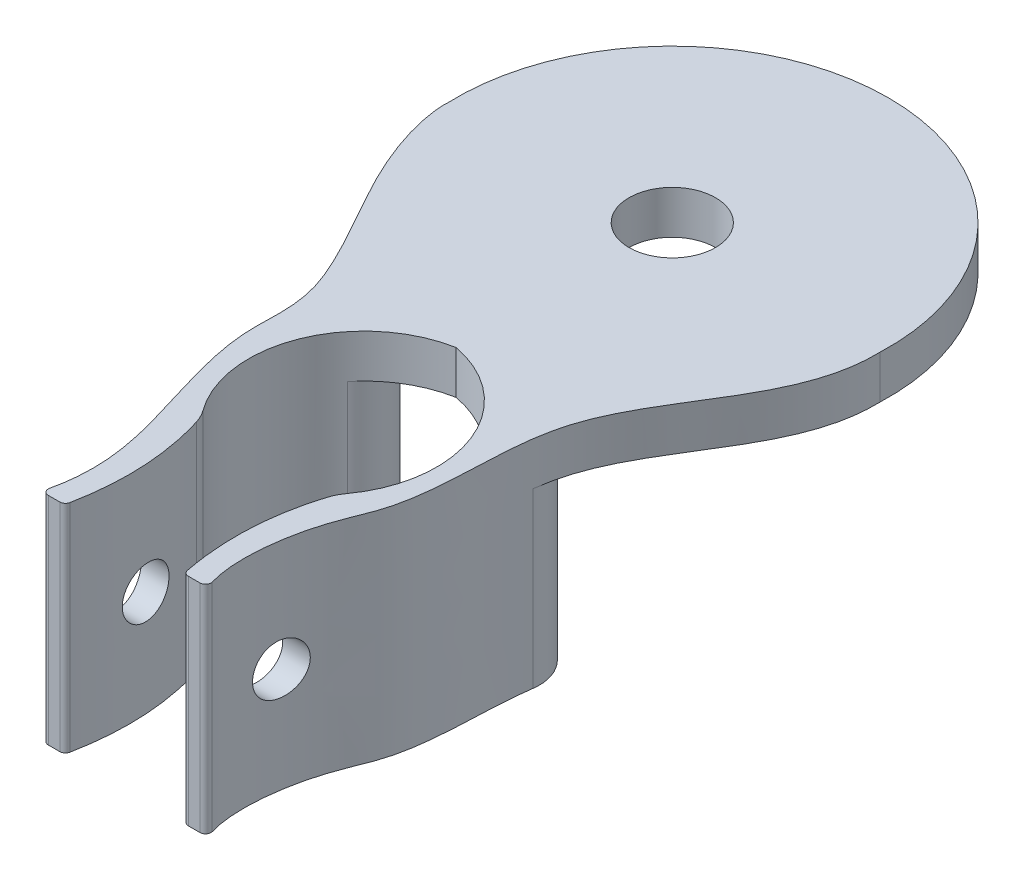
ISO-10303-21;
HEADER;
FILE_DESCRIPTION(('STEP AP214'),'2;1');
FILE_NAME('part.step','',(''),(''),'','','');
FILE_SCHEMA(('AUTOMOTIVE_DESIGN { 1 0 10303 214 1 1 1 1 }'));
ENDSEC;
DATA;
#1=APPLICATION_CONTEXT('core data for automotive mechanical design processes');
#2=APPLICATION_PROTOCOL_DEFINITION('international standard','automotive_design',2000,#1);
#3=PRODUCT_CONTEXT('',#1,'mechanical');
#4=PRODUCT('Part','Part','',(#3));
#5=PRODUCT_RELATED_PRODUCT_CATEGORY('part','',(#4));
#6=PRODUCT_DEFINITION_FORMATION('','',#4);
#7=PRODUCT_DEFINITION_CONTEXT('part definition',#1,'design');
#8=PRODUCT_DEFINITION('design','',#6,#7);
#9=PRODUCT_DEFINITION_SHAPE('','',#8);
#10=(LENGTH_UNIT() NAMED_UNIT(*) SI_UNIT(.MILLI.,.METRE.));
#11=(NAMED_UNIT(*) PLANE_ANGLE_UNIT() SI_UNIT($,.RADIAN.));
#12=(NAMED_UNIT(*) SI_UNIT($,.STERADIAN.) SOLID_ANGLE_UNIT());
#13=UNCERTAINTY_MEASURE_WITH_UNIT(LENGTH_MEASURE(1.E-05),#10,'distance_accuracy_value','');
#14=(GEOMETRIC_REPRESENTATION_CONTEXT(3) GLOBAL_UNCERTAINTY_ASSIGNED_CONTEXT((#13)) GLOBAL_UNIT_ASSIGNED_CONTEXT((#10,
#11,#12)) REPRESENTATION_CONTEXT('',''));
#15=CARTESIAN_POINT('',(0.,0.,0.));
#16=DIRECTION('',(0.,0.,1.));
#17=DIRECTION('',(1.,0.,0.));
#18=AXIS2_PLACEMENT_3D('',#15,#16,#17);
#19=CARTESIAN_POINT('',(-6.93411925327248,0.,15.7482204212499));
#20=DIRECTION('',(0.,-1.,0.));
#21=DIRECTION('',(0.,0.,-1.));
#22=AXIS2_PLACEMENT_3D('',#19,#20,#21);
#23=PLANE('',#22);
#24=CARTESIAN_POINT('',(-4.47025085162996,0.,14.7024333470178));
#25=DIRECTION('',(0.,-1.,0.));
#26=DIRECTION('',(0.,0.,-1.));
#27=AXIS2_PLACEMENT_3D('',#24,#25,#26);
#28=CIRCLE('',#27,2.54);
#29=CARTESIAN_POINT('',(-6.99147324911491,0.,15.0107150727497));
#30=VERTEX_POINT('',#29);
#31=CARTESIAN_POINT('',(-3.73136641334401,0.,12.2722790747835));
#32=VERTEX_POINT('',#31);
#33=EDGE_CURVE('E264',#30,#32,#28,.T.);
#34=ORIENTED_EDGE('',*,*,#33,.T.);
#35=CARTESIAN_POINT('',(-5.96798757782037,0.,13.4760754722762));
#36=DIRECTION('',(0.,-1.,0.));
#37=DIRECTION('',(0.,0.,-1.));
#38=AXIS2_PLACEMENT_3D('',#35,#36,#37);
#39=CIRCLE('',#38,2.54);
#40=CARTESIAN_POINT('',(-3.99843270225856,0.,15.0799624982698));
#41=VERTEX_POINT('',#40);
#42=EDGE_CURVE('E269',#32,#41,#39,.T.);
#43=ORIENTED_EDGE('',*,*,#42,.T.);
#44=CARTESIAN_POINT('',(1.25597785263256,0.,19.3588384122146));
#45=DIRECTION('',(0.,-1.,0.));
#46=DIRECTION('',(0.,0.,1.));
#47=AXIS2_PLACEMENT_3D('',#44,#45,#46);
#48=CIRCLE('',#47,6.77625334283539);
#49=CARTESIAN_POINT('',(-4.21241176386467,0.,23.3606285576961));
#50=VERTEX_POINT('',#49);
#51=EDGE_CURVE('E325',#50,#41,#48,.T.);
#52=ORIENTED_EDGE('',*,*,#51,.F.);
#53=CARTESIAN_POINT('',(-6.26217420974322,0.,24.8606531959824));
#54=DIRECTION('',(0.,1.,0.));
#55=DIRECTION('',(0.,0.,-1.));
#56=AXIS2_PLACEMENT_3D('',#53,#54,#55);
#57=CIRCLE('',#56,2.54);
#58=CARTESIAN_POINT('',(-3.83488723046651,0.,24.1124032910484));
#59=VERTEX_POINT('',#58);
#60=EDGE_CURVE('E320',#59,#50,#57,.T.);
#61=ORIENTED_EDGE('',*,*,#60,.F.);
#62=CARTESIAN_POINT('',(-3.45189480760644,0.,31.932369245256));
#63=CARTESIAN_POINT('',(-3.03837590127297,0.,29.8419376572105));
#64=CARTESIAN_POINT('',(-3.0285914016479,0.,27.2020407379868));
#65=CARTESIAN_POINT('',(-3.6668448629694,0.,24.6575247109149));
#66=CARTESIAN_POINT('',(-3.83488723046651,0.,24.1124032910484));
#67=B_SPLINE_CURVE_WITH_KNOTS('',3,(#62,#63,#64,#65,#66),.UNSPECIFIED.,.F.,.F.,(4,1,4),
(0.0550755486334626,0.772138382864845,0.969570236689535),.UNSPECIFIED.);
#68=CARTESIAN_POINT('',(-3.45189480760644,0.,31.932369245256));
#69=VERTEX_POINT('',#68);
#70=EDGE_CURVE('E316',#69,#59,#67,.T.);
#71=ORIENTED_EDGE('',*,*,#70,.F.);
#72=CARTESIAN_POINT('',(-3.77597646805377,0.,31.8682610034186));
#73=DIRECTION('',(0.,1.,0.));
#74=DIRECTION('',(0.,0.,-1.));
#75=AXIS2_PLACEMENT_3D('',#72,#73,#74);
#76=CIRCLE('',#75,0.330361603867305);
#77=CARTESIAN_POINT('',(-3.77597646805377,0.,32.1986226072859));
#78=VERTEX_POINT('',#77);
#79=EDGE_CURVE('E314',#78,#69,#76,.T.);
#80=ORIENTED_EDGE('',*,*,#79,.F.);
#81=DIRECTION('',(1.,0.,0.));
#82=VECTOR('',#81,1.);
#83=CARTESIAN_POINT('',(-4.45105676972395,0.,32.1986226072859));
#84=LINE('',#83,#82);
#85=CARTESIAN_POINT('',(-4.45105676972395,0.,32.1986226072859));
#86=VERTEX_POINT('',#85);
#87=EDGE_CURVE('E301',#86,#78,#84,.T.);
#88=ORIENTED_EDGE('',*,*,#87,.F.);
#89=CARTESIAN_POINT('',(-4.45105676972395,0.,31.8682610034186));
#90=DIRECTION('',(0.,1.,0.));
#91=DIRECTION('',(0.,0.,1.));
#92=AXIS2_PLACEMENT_3D('',#89,#90,#91);
#93=CIRCLE('',#92,0.330361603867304);
#94=CARTESIAN_POINT('',(-4.77346849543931,0.,31.7962230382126));
#95=VERTEX_POINT('',#94);
#96=EDGE_CURVE('E296',#95,#86,#93,.T.);
#97=ORIENTED_EDGE('',*,*,#96,.F.);
#98=CARTESIAN_POINT('',(-12.6900757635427,0.,0.50197322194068));
#99=CARTESIAN_POINT('',(-12.7085946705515,0.,0.534595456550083));
#100=CARTESIAN_POINT('',(-12.9445111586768,0.,3.81873144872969));
#101=CARTESIAN_POINT('',(-6.44251711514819,0.,13.8864500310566));
#102=CARTESIAN_POINT('',(-7.36026092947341,0.,18.4591788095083));
#103=CARTESIAN_POINT('',(-5.27387900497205,0.,24.7590934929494));
#104=CARTESIAN_POINT('',(-4.15604476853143,0.,29.0328933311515));
#105=CARTESIAN_POINT('',(-4.77346849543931,0.,31.7962230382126));
#106=B_SPLINE_CURVE_WITH_KNOTS('',3,(#98,#99,#100,#101,#102,#103,#104,#105),.UNSPECIFIED.,.F.,
.F.,(4,1,1,1,1,4),(0.,0.279659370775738,0.433863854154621,0.566787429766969,0.759908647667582,
0.988953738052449),.UNSPECIFIED.);
#107=EDGE_CURVE('E294',#30,#95,#106,.T.);
#108=ORIENTED_EDGE('',*,*,#107,.F.);
#109=EDGE_LOOP('',(#34,#43,#52,#61,#71,#80,#88,#97,#108));
#110=FACE_BOUND('',#109,.T.);
#111=ADVANCED_FACE('F33',(#110),#23,.T.);
#112=CARTESIAN_POINT('',(-12.6900757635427,12.7,0.50197322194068));
#113=CARTESIAN_POINT('',(-12.7085946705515,12.7,0.534595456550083));
#114=CARTESIAN_POINT('',(-12.9445111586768,12.7,3.81873144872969));
#115=CARTESIAN_POINT('',(-6.44251711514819,12.7,13.8864500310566));
#116=CARTESIAN_POINT('',(-7.36026092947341,12.7,18.4591788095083));
#117=CARTESIAN_POINT('',(-5.27387900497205,12.7,24.7590934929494));
#118=CARTESIAN_POINT('',(-4.15604476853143,12.7,29.0328933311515));
#119=CARTESIAN_POINT('',(-4.77346849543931,12.7,31.7962230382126));
#120=B_SPLINE_CURVE_WITH_KNOTS('',3,(#112,#113,#114,#115,#116,#117,#118,#119),.UNSPECIFIED.,.F.,
.F.,(4,1,1,1,1,4),(0.,0.279659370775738,0.433863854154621,0.566787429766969,0.759908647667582,
0.988953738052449),.UNSPECIFIED.);
#121=DIRECTION('',(0.,-1.,0.));
#122=VECTOR('',#121,1.);
#123=SURFACE_OF_LINEAR_EXTRUSION('',#120,#122);
#124=CARTESIAN_POINT('',(-4.95633280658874,6.16582696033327,26.2198274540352));
#125=CARTESIAN_POINT('',(-4.95633093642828,6.24700173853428,26.2198332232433));
#126=CARTESIAN_POINT('',(-4.95468988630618,6.32825554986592,26.2265713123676));
#127=CARTESIAN_POINT('',(-4.94984501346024,6.44829752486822,26.2465882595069));
#128=CARTESIAN_POINT('',(-4.94783030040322,6.48803576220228,26.2549227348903));
#129=CARTESIAN_POINT('',(-4.94303519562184,6.56668331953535,26.2748321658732));
#130=CARTESIAN_POINT('',(-4.94025417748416,6.60559193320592,26.2864097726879));
#131=CARTESIAN_POINT('',(-4.93082928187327,6.72045100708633,26.3258242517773));
#132=CARTESIAN_POINT('',(-4.92309473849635,6.79474723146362,26.3583785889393));
#133=CARTESIAN_POINT('',(-4.90513999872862,6.93677734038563,26.4350646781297));
#134=CARTESIAN_POINT('',(-4.89491932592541,7.00450996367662,26.4791986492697));
#135=CARTESIAN_POINT('',(-4.8780643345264,7.10031269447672,26.5534114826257));
#136=CARTESIAN_POINT('',(-4.87214051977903,7.13149723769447,26.5797179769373));
#137=CARTESIAN_POINT('',(-4.85988117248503,7.19150813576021,26.6347494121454));
#138=CARTESIAN_POINT('',(-4.85354604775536,7.22033676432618,26.6634719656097));
#139=CARTESIAN_POINT('',(-4.83403048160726,7.3030778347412,26.7530398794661));
#140=CARTESIAN_POINT('',(-4.82033748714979,7.35325866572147,26.8172957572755));
#141=CARTESIAN_POINT('',(-4.79194668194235,7.44340495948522,26.954756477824));
#142=CARTESIAN_POINT('',(-4.77723230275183,7.48308343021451,27.0281449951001));
#143=CARTESIAN_POINT('',(-4.7478441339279,7.54952543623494,27.1805759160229));
#144=CARTESIAN_POINT('',(-4.73317034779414,7.57628789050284,27.2596187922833));
#145=CARTESIAN_POINT('',(-4.70439156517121,7.61634436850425,27.4221089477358));
#146=CARTESIAN_POINT('',(-4.69029466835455,7.62948593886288,27.5055953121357));
#147=CARTESIAN_POINT('',(-4.66344952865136,7.64131172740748,27.6738028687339));
#148=CARTESIAN_POINT('',(-4.6507012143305,7.6399967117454,27.7585239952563));
#149=CARTESIAN_POINT('',(-4.62710919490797,7.62290283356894,27.9259812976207));
#150=CARTESIAN_POINT('',(-4.61624936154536,7.60725441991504,28.0087284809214));
#151=CARTESIAN_POINT('',(-4.59654475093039,7.56201088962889,28.1705694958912));
#152=CARTESIAN_POINT('',(-4.5876997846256,7.53241708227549,28.249663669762));
#153=CARTESIAN_POINT('',(-4.57219484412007,7.46064779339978,28.4005773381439));
#154=CARTESIAN_POINT('',(-4.56550202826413,7.41868223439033,28.4724933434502));
#155=CARTESIAN_POINT('',(-4.55397270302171,7.32316274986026,28.6083335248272));
#156=CARTESIAN_POINT('',(-4.54913611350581,7.26960932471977,28.6722580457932));
#157=CARTESIAN_POINT('',(-4.54107983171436,7.15291119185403,28.7897424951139));
#158=CARTESIAN_POINT('',(-4.53784746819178,7.0898469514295,28.8433815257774));
#159=CARTESIAN_POINT('',(-4.53260550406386,6.9556019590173,28.9393752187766));
#160=CARTESIAN_POINT('',(-4.53059590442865,6.88442120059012,28.9817298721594));
#161=CARTESIAN_POINT('',(-4.52746056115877,6.73592427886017,29.0539565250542));
#162=CARTESIAN_POINT('',(-4.52633526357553,6.65860504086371,29.0838222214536));
#163=CARTESIAN_POINT('',(-4.52469256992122,6.50005194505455,29.1301893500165));
#164=CARTESIAN_POINT('',(-4.52417517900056,6.41881805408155,29.1466906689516));
#165=CARTESIAN_POINT('',(-4.5235805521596,6.25457859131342,29.1658783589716));
#166=CARTESIAN_POINT('',(-4.52350414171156,6.17156998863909,29.1685388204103));
#167=CARTESIAN_POINT('',(-4.52376568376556,6.0062827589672,29.1598991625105));
#168=CARTESIAN_POINT('',(-4.52410363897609,5.92400413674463,29.1485989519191));
#169=CARTESIAN_POINT('',(-4.52531127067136,5.76247392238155,29.1123509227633));
#170=CARTESIAN_POINT('',(-4.52618119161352,5.68322373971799,29.0873968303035));
#171=CARTESIAN_POINT('',(-4.52869534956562,5.53004418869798,29.0245498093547));
#172=CARTESIAN_POINT('',(-4.53033958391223,5.45611480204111,28.9866569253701));
#173=CARTESIAN_POINT('',(-4.5347255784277,5.315737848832,28.8990565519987));
#174=CARTESIAN_POINT('',(-4.53746648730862,5.24928453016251,28.8493582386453));
#175=CARTESIAN_POINT('',(-4.54439265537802,5.12568716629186,28.7395737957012));
#176=CARTESIAN_POINT('',(-4.54857787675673,5.0685428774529,28.6794879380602));
#177=CARTESIAN_POINT('',(-4.55868346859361,4.96528612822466,28.5508211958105));
#178=CARTESIAN_POINT('',(-4.5646002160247,4.91915099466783,28.4822582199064));
#179=CARTESIAN_POINT('',(-4.57836141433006,4.83902980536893,28.3385472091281));
#180=CARTESIAN_POINT('',(-4.58620583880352,4.80504358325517,28.2633992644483));
#181=CARTESIAN_POINT('',(-4.60386021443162,4.75008054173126,28.1086349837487));
#182=CARTESIAN_POINT('',(-4.61367186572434,4.72911503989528,28.0290148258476));
#183=CARTESIAN_POINT('',(-4.63510249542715,4.70071797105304,27.8676361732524));
#184=CARTESIAN_POINT('',(-4.64672157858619,4.69328718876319,27.7858775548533));
#185=CARTESIAN_POINT('',(-4.67156280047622,4.69204470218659,27.6216286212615));
#186=CARTESIAN_POINT('',(-4.6848003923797,4.69837582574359,27.5391395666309));
#187=CARTESIAN_POINT('',(-4.71227529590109,4.72466608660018,27.3765440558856));
#188=CARTESIAN_POINT('',(-4.72651271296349,4.74462666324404,27.2964378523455));
#189=CARTESIAN_POINT('',(-4.75560874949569,4.79804313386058,27.1394370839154));
#190=CARTESIAN_POINT('',(-4.77047368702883,4.83171169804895,27.0626152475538));
#191=CARTESIAN_POINT('',(-4.79250147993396,4.89156529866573,26.9525368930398));
#192=CARTESIAN_POINT('',(-4.79980055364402,4.91308011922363,26.9166966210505));
#193=CARTESIAN_POINT('',(-4.81422874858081,4.95911590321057,26.8469095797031));
#194=CARTESIAN_POINT('',(-4.82135768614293,4.98363995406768,26.8129648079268));
#195=CARTESIAN_POINT('',(-4.84240612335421,5.06173030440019,26.714069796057));
#196=CARTESIAN_POINT('',(-4.85592141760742,5.11963802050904,26.6523839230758));
#197=CARTESIAN_POINT('',(-4.88109901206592,5.24537960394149,26.5396758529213));
#198=CARTESIAN_POINT('',(-4.89276166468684,5.31321157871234,26.4886516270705));
#199=CARTESIAN_POINT('',(-4.908284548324,5.42040035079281,26.4216479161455));
#200=CARTESIAN_POINT('',(-4.91310441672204,5.45677478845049,26.4010094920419));
#201=CARTESIAN_POINT('',(-4.92206046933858,5.53117479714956,26.3628837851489));
#202=CARTESIAN_POINT('',(-4.92619724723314,5.56919889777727,26.3453937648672));
#203=CARTESIAN_POINT('',(-4.93748410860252,5.68533852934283,26.2978861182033));
#204=CARTESIAN_POINT('',(-4.94352972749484,5.76565119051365,26.2727497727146));
#205=CARTESIAN_POINT('',(-4.95069263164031,5.89970092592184,26.2430743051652));
#206=CARTESIAN_POINT('',(-4.95280201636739,5.95251744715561,26.2343717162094));
#207=CARTESIAN_POINT('',(-4.95562270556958,6.05882018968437,26.2227464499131));
#208=CARTESIAN_POINT('',(-4.95633403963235,6.11230639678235,26.2198236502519));
#209=CARTESIAN_POINT('',(-4.95633280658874,6.16582696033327,26.2198274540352));
#210=B_SPLINE_CURVE_WITH_KNOTS('',3,(#124,#125,#126,#127,#128,#129,#130,#131,#132,#133,#134,
#135,#136,#137,#138,#139,#140,#141,#142,#143,#144,#145,#146,#147,#148,#149,#150,#151,#152,#153,
#154,#155,#156,#157,#158,#159,#160,#161,#162,#163,#164,#165,#166,#167,#168,#169,#170,#171,#172,
#173,#174,#175,#176,#177,#178,#179,#180,#181,#182,#183,#184,#185,#186,#187,#188,#189,#190,#191,
#192,#193,#194,#195,#196,#197,#198,#199,#200,#201,#202,#203,#204,#205,#206,#207,#208,#209),
.UNSPECIFIED.,.T.,.F.,(4,2,2,2,2,2,2,2,2,2,2,2,2,2,2,2,2,2,2,2,2,2,2,2,2,2,2,2,2,2,2,2,2,2,2,2,
2,2,2,2,2,2,4),(0.,0.24329340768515,0.365133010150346,0.487072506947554,0.730312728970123,
0.973599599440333,1.09715425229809,1.2205882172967,1.46740609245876,1.7203991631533,
1.97341340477,2.22922992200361,2.48503288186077,2.73853065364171,2.99200463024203,
3.24140354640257,3.49079169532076,3.73817734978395,3.98556320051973,4.23307375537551,
4.48058640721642,4.72856222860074,4.97653967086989,5.22463115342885,5.47272178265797,
5.72062020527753,5.96851213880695,6.21588904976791,6.46326257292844,6.71085081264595,
6.95845340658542,7.20863800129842,7.4588490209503,7.71309952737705,7.84027490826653,
7.96758187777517,8.22330883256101,8.47898708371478,8.60514352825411,8.73118974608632,
8.98282541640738,9.14323824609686,9.30364768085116),.UNSPECIFIED.);
#211=CARTESIAN_POINT('',(-4.95633280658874,6.16582696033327,26.2198274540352));
#212=VERTEX_POINT('',#211);
#213=EDGE_CURVE('E37',#212,#212,#210,.T.);
#214=ORIENTED_EDGE('',*,*,#213,.T.);
#215=EDGE_LOOP('',(#214));
#216=FACE_BOUND('',#215,.T.);
#217=CARTESIAN_POINT('',(-12.6900757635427,10.16,0.50197322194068));
#218=CARTESIAN_POINT('',(-12.7085946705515,10.16,0.534595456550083));
#219=CARTESIAN_POINT('',(-12.9445111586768,10.16,3.81873144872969));
#220=CARTESIAN_POINT('',(-6.44251711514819,10.16,13.8864500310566));
#221=CARTESIAN_POINT('',(-7.36026092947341,10.16,18.4591788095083));
#222=CARTESIAN_POINT('',(-5.27387900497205,10.16,24.7590934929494));
#223=CARTESIAN_POINT('',(-4.15604476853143,10.16,29.0328933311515));
#224=CARTESIAN_POINT('',(-4.77346849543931,10.16,31.7962230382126));
#225=B_SPLINE_CURVE_WITH_KNOTS('',3,(#217,#218,#219,#220,#221,#222,#223,#224),.UNSPECIFIED.,.F.,
.F.,(4,1,1,1,1,4),(0.,0.279659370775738,0.433863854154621,0.566787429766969,0.759908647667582,
0.988953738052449),.UNSPECIFIED.);
#226=CARTESIAN_POINT('',(-12.6900757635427,10.16,0.501973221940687));
#227=VERTEX_POINT('',#226);
#228=CARTESIAN_POINT('',(-6.99147324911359,10.16,15.0107150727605));
#229=VERTEX_POINT('',#228);
#230=EDGE_CURVE('E185',#227,#229,#225,.T.);
#231=ORIENTED_EDGE('',*,*,#230,.T.);
#232=DIRECTION('',(0.,-1.,0.));
#233=VECTOR('',#232,1.);
#234=CARTESIAN_POINT('',(-6.99147324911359,10.16,15.0107150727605));
#235=LINE('',#234,#233);
#236=EDGE_CURVE('E262',#229,#30,#235,.T.);
#237=ORIENTED_EDGE('',*,*,#236,.T.);
#238=ORIENTED_EDGE('',*,*,#107,.T.);
#239=DIRECTION('',(0.,-1.,0.));
#240=VECTOR('',#239,1.);
#241=CARTESIAN_POINT('',(-4.77346849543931,12.7,31.7962230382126));
#242=LINE('',#241,#240);
#243=CARTESIAN_POINT('',(-4.77346849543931,12.7,31.7962230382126));
#244=VERTEX_POINT('',#243);
#245=EDGE_CURVE('E245',#244,#95,#242,.T.);
#246=ORIENTED_EDGE('',*,*,#245,.F.);
#247=CARTESIAN_POINT('',(-12.6900757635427,12.7,0.501973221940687));
#248=VERTEX_POINT('',#247);
#249=EDGE_CURVE('E346',#248,#244,#120,.T.);
#250=ORIENTED_EDGE('',*,*,#249,.F.);
#251=DIRECTION('',(0.,-1.,0.));
#252=VECTOR('',#251,1.);
#253=CARTESIAN_POINT('',(-12.6900757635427,12.7,0.501973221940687));
#254=LINE('',#253,#252);
#255=EDGE_CURVE('E206',#248,#227,#254,.T.);
#256=ORIENTED_EDGE('',*,*,#255,.T.);
#257=EDGE_LOOP('',(#231,#237,#238,#246,#250,#256));
#258=FACE_BOUND('',#257,.T.);
#259=ADVANCED_FACE('F366',(#216,#258),#123,.F.);
#260=CARTESIAN_POINT('',(1.25597785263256,12.7,19.3588384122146));
#261=DIRECTION('',(0.,-1.,0.));
#262=DIRECTION('',(0.,0.,-1.));
#263=AXIS2_PLACEMENT_3D('',#260,#261,#262);
#264=CYLINDRICAL_SURFACE('',#263,6.77625334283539);
#265=ORIENTED_EDGE('',*,*,#51,.T.);
#266=DIRECTION('',(0.,-1.,0.));
#267=VECTOR('',#266,1.);
#268=CARTESIAN_POINT('',(-3.99843270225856,12.7,15.0799624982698));
#269=LINE('',#268,#267);
#270=CARTESIAN_POINT('',(-3.99843270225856,10.16,15.0799624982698));
#271=VERTEX_POINT('',#270);
#272=EDGE_CURVE('E271',#41,#271,#269,.F.);
#273=ORIENTED_EDGE('',*,*,#272,.T.);
#274=CARTESIAN_POINT('',(1.25597785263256,10.16,19.3588384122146));
#275=DIRECTION('',(0.,1.,0.));
#276=DIRECTION('',(0.,0.,1.));
#277=AXIS2_PLACEMENT_3D('',#274,#275,#276);
#278=CIRCLE('',#277,6.77625334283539);
#279=CARTESIAN_POINT('',(0.,10.16,12.7));
#280=VERTEX_POINT('',#279);
#281=EDGE_CURVE('E281',#271,#280,#278,.F.);
#282=ORIENTED_EDGE('',*,*,#281,.T.);
#283=DIRECTION('',(0.,-1.,0.));
#284=VECTOR('',#283,1.);
#285=CARTESIAN_POINT('',(0.,12.7,12.7));
#286=LINE('',#285,#284);
#287=CARTESIAN_POINT('',(0.,12.7,12.7));
#288=VERTEX_POINT('',#287);
#289=EDGE_CURVE('E228',#288,#280,#286,.T.);
#290=ORIENTED_EDGE('',*,*,#289,.F.);
#291=CARTESIAN_POINT('',(1.25597785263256,12.7,19.3588384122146));
#292=DIRECTION('',(0.,-1.,0.));
#293=DIRECTION('',(0.,0.,1.));
#294=AXIS2_PLACEMENT_3D('',#291,#292,#293);
#295=CIRCLE('',#294,6.77625334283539);
#296=CARTESIAN_POINT('',(-4.21241176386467,12.7,23.3606285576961));
#297=VERTEX_POINT('',#296);
#298=EDGE_CURVE('E496',#297,#288,#295,.T.);
#299=ORIENTED_EDGE('',*,*,#298,.F.);
#300=DIRECTION('',(0.,-1.,0.));
#301=VECTOR('',#300,1.);
#302=CARTESIAN_POINT('',(-4.21241176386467,12.7,23.3606285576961));
#303=LINE('',#302,#301);
#304=EDGE_CURVE('E230',#297,#50,#303,.T.);
#305=ORIENTED_EDGE('',*,*,#304,.T.);
#306=EDGE_LOOP('',(#265,#273,#282,#290,#299,#305));
#307=FACE_BOUND('',#306,.T.);
#308=ADVANCED_FACE('F371',(#307),#264,.F.);
#309=CARTESIAN_POINT('',(-1.25597785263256,12.7,19.3588384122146));
#310=DIRECTION('',(0.,-1.,0.));
#311=DIRECTION('',(0.,0.,-1.));
#312=AXIS2_PLACEMENT_3D('',#309,#310,#311);
#313=CYLINDRICAL_SURFACE('',#312,6.77625334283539);
#314=CARTESIAN_POINT('',(-1.25597785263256,10.16,19.3588384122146));
#315=DIRECTION('',(0.,1.,0.));
#316=DIRECTION('',(0.,0.,1.));
#317=AXIS2_PLACEMENT_3D('',#314,#315,#316);
#318=CIRCLE('',#317,6.77625334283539);
#319=CARTESIAN_POINT('',(3.97241342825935,10.16,15.0482080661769));
#320=VERTEX_POINT('',#319);
#321=EDGE_CURVE('E53',#280,#320,#318,.F.);
#322=ORIENTED_EDGE('',*,*,#321,.T.);
#323=DIRECTION('',(0.,-1.,0.));
#324=VECTOR('',#323,1.);
#325=CARTESIAN_POINT('',(3.97241342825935,12.7,15.0482080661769));
#326=LINE('',#325,#324);
#327=CARTESIAN_POINT('',(3.97241342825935,0.,15.0482080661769));
#328=VERTEX_POINT('',#327);
#329=EDGE_CURVE('E57',#320,#328,#326,.T.);
#330=ORIENTED_EDGE('',*,*,#329,.T.);
#331=CARTESIAN_POINT('',(-1.25597785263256,0.,19.3588384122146));
#332=DIRECTION('',(0.,-1.,0.));
#333=DIRECTION('',(0.,0.,-1.));
#334=AXIS2_PLACEMENT_3D('',#331,#332,#333);
#335=CIRCLE('',#334,6.77625334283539);
#336=CARTESIAN_POINT('',(4.21241176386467,0.,23.3606285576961));
#337=VERTEX_POINT('',#336);
#338=EDGE_CURVE('E327',#328,#337,#335,.T.);
#339=ORIENTED_EDGE('',*,*,#338,.T.);
#340=DIRECTION('',(0.,-1.,0.));
#341=VECTOR('',#340,1.);
#342=CARTESIAN_POINT('',(4.21241176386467,12.7,23.3606285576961));
#343=LINE('',#342,#341);
#344=CARTESIAN_POINT('',(4.21241176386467,12.7,23.3606285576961));
#345=VERTEX_POINT('',#344);
#346=EDGE_CURVE('E225',#345,#337,#343,.T.);
#347=ORIENTED_EDGE('',*,*,#346,.F.);
#348=CARTESIAN_POINT('',(-1.25597785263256,12.7,19.3588384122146));
#349=DIRECTION('',(0.,-1.,0.));
#350=DIRECTION('',(0.,0.,-1.));
#351=AXIS2_PLACEMENT_3D('',#348,#349,#350);
#352=CIRCLE('',#351,6.77625334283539);
#353=EDGE_CURVE('E494',#288,#345,#352,.T.);
#354=ORIENTED_EDGE('',*,*,#353,.F.);
#355=ORIENTED_EDGE('',*,*,#289,.T.);
#356=EDGE_LOOP('',(#322,#330,#339,#347,#354,#355));
#357=FACE_BOUND('',#356,.T.);
#358=ADVANCED_FACE('F431',(#357),#313,.F.);
#359=CARTESIAN_POINT('',(4.77346849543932,12.7,31.7962230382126));
#360=CARTESIAN_POINT('',(4.26261652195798,12.7,30.1479997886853));
#361=CARTESIAN_POINT('',(4.52523901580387,12.7,26.6602313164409));
#362=CARTESIAN_POINT('',(7.08560364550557,12.7,20.9954102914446));
#363=CARTESIAN_POINT('',(5.48854782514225,12.7,11.2875043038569));
#364=CARTESIAN_POINT('',(12.8342449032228,12.7,5.63803468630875));
#365=CARTESIAN_POINT('',(12.6900757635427,12.7,0.501973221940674));
#366=B_SPLINE_CURVE_WITH_KNOTS('',3,(#359,#360,#361,#362,#363,#364,#365),.UNSPECIFIED.,.F.,.F.,
(4,1,1,1,4),(0.,0.239032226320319,0.296991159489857,0.579589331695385,1.),.UNSPECIFIED.);
#367=DIRECTION('',(0.,-1.,0.));
#368=VECTOR('',#367,1.);
#369=SURFACE_OF_LINEAR_EXTRUSION('',#366,#368);
#370=CARTESIAN_POINT('',(4.95845871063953,6.16582696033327,26.2198274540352));
#371=CARTESIAN_POINT('',(4.95845648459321,6.08479950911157,26.2198332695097));
#372=CARTESIAN_POINT('',(4.95671313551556,6.00369267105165,26.2265473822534));
#373=CARTESIAN_POINT('',(4.9515812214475,5.88387338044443,26.2464895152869));
#374=CARTESIAN_POINT('',(4.94944838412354,5.84420943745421,26.2547926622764));
#375=CARTESIAN_POINT('',(4.94438042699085,5.76571085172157,26.274625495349));
#376=CARTESIAN_POINT('',(4.94144465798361,5.72687690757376,26.2861577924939));
#377=CARTESIAN_POINT('',(4.93151565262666,5.61225019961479,26.3254107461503));
#378=CARTESIAN_POINT('',(4.92339080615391,5.53810931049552,26.3578250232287));
#379=CARTESIAN_POINT('',(4.90463187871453,5.39635927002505,26.4341701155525));
#380=CARTESIAN_POINT('',(4.89399726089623,5.32875152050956,26.478103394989));
#381=CARTESIAN_POINT('',(4.87654497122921,5.23301634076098,26.5520403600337));
#382=CARTESIAN_POINT('',(4.87041646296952,5.20180090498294,26.5782942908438));
#383=CARTESIAN_POINT('',(4.85776718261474,5.14172291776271,26.6332234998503));
#384=CARTESIAN_POINT('',(4.85124680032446,5.11285809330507,26.6618963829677));
#385=CARTESIAN_POINT('',(4.83121393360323,5.02999863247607,26.7513227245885));
#386=CARTESIAN_POINT('',(4.81722734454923,4.97972615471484,26.8154938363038));
#387=CARTESIAN_POINT('',(4.78834285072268,4.88930263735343,26.952922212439));
#388=CARTESIAN_POINT('',(4.77343060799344,4.84945588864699,27.0263755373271));
#389=CARTESIAN_POINT('',(4.74375116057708,4.78270859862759,27.1789889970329));
#390=CARTESIAN_POINT('',(4.72898396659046,4.75580900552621,27.2581495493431));
#391=CARTESIAN_POINT('',(4.70008899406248,4.71555381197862,27.4207926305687));
#392=CARTESIAN_POINT('',(4.68596872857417,4.70233092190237,27.5043093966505));
#393=CARTESIAN_POINT('',(4.65905230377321,4.69035619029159,27.6725875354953));
#394=CARTESIAN_POINT('',(4.64625607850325,4.6916036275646,27.7573488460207));
#395=CARTESIAN_POINT('',(4.62248192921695,4.7085721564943,27.9248639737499));
#396=CARTESIAN_POINT('',(4.61148826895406,4.7241591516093,28.0076291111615));
#397=CARTESIAN_POINT('',(4.59139006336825,4.76927992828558,28.1695070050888));
#398=CARTESIAN_POINT('',(4.58228535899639,4.79881253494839,28.2486200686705));
#399=CARTESIAN_POINT('',(4.56613190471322,4.87050792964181,28.3996769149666));
#400=CARTESIAN_POINT('',(4.55905473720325,4.91247744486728,28.4717094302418));
#401=CARTESIAN_POINT('',(4.5466782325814,5.00803989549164,28.6077719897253));
#402=CARTESIAN_POINT('',(4.54137881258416,5.06163228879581,28.6718024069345));
#403=CARTESIAN_POINT('',(4.53238140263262,5.17843369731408,28.7894713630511));
#404=CARTESIAN_POINT('',(4.52867064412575,5.24156030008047,28.8431907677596));
#405=CARTESIAN_POINT('',(4.52251523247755,5.37595870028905,28.9393228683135));
#406=CARTESIAN_POINT('',(4.52007057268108,5.44723045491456,28.9817356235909));
#407=CARTESIAN_POINT('',(4.51616716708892,5.59583696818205,29.0540018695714));
#408=CARTESIAN_POINT('',(4.51470768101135,5.67316712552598,29.0838647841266));
#409=CARTESIAN_POINT('',(4.51253618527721,5.83174552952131,29.1302233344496));
#410=CARTESIAN_POINT('',(4.51182418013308,5.9129937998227,29.1467188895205));
#411=CARTESIAN_POINT('',(4.51100322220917,6.07721570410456,29.1658849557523));
#412=CARTESIAN_POINT('',(4.51089505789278,6.16019145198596,29.1685373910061));
#413=CARTESIAN_POINT('',(4.51125973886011,6.32541215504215,29.1598928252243));
#414=CARTESIAN_POINT('',(4.51173258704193,6.40765710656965,29.1485957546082));
#415=CARTESIAN_POINT('',(4.51336065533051,6.56911727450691,29.1123665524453));
#416=CARTESIAN_POINT('',(4.51451616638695,6.64833118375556,29.0874286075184));
#417=CARTESIAN_POINT('',(4.51771634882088,6.80143947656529,29.024628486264));
#418=CARTESIAN_POINT('',(4.5197610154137,6.87533388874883,28.9867663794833));
#419=CARTESIAN_POINT('',(4.52500919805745,7.01565075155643,28.8992406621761));
#420=CARTESIAN_POINT('',(4.52821190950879,7.0820783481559,28.8495852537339));
#421=CARTESIAN_POINT('',(4.53605912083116,7.20563248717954,28.7399020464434));
#422=CARTESIAN_POINT('',(4.54070359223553,7.26275921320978,28.679874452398));
#423=CARTESIAN_POINT('',(4.55166591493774,7.36603739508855,28.5512843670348));
#424=CARTESIAN_POINT('',(4.55798161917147,7.41220278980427,28.4827328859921));
#425=CARTESIAN_POINT('',(4.57243330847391,7.49238589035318,28.3390377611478));
#426=CARTESIAN_POINT('',(4.58056928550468,7.52640364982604,28.2638941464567));
#427=CARTESIAN_POINT('',(4.59869529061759,7.58146295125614,28.1090326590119));
#428=CARTESIAN_POINT('',(4.60868909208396,7.60247770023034,28.0293057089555));
#429=CARTESIAN_POINT('',(4.63038584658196,7.63093564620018,27.8676945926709));
#430=CARTESIAN_POINT('',(4.6420888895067,7.63837812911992,27.7858103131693));
#431=CARTESIAN_POINT('',(4.66704632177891,7.63960045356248,27.6213301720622));
#432=CARTESIAN_POINT('',(4.68031518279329,7.63324157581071,27.5387354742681));
#433=CARTESIAN_POINT('',(4.70786966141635,7.60686158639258,27.375942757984));
#434=CARTESIAN_POINT('',(4.72215537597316,7.58683917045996,27.2957449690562));
#435=CARTESIAN_POINT('',(4.75141223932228,7.53330734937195,27.1386885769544));
#436=CARTESIAN_POINT('',(4.76639043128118,7.49960134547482,27.0618975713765));
#437=CARTESIAN_POINT('',(4.78868177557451,7.43970713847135,26.9518814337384));
#438=CARTESIAN_POINT('',(4.79608437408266,7.41818125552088,26.9160644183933));
#439=CARTESIAN_POINT('',(4.81075215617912,7.37212952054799,26.8463281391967));
#440=CARTESIAN_POINT('',(4.81801718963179,7.34760058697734,26.8124108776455));
#441=CARTESIAN_POINT('',(4.83953521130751,7.26946507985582,26.7135508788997));
#442=CARTESIAN_POINT('',(4.85343253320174,7.21151855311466,26.651883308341));
#443=CARTESIAN_POINT('',(4.87945954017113,7.08570544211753,26.5392212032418));
#444=CARTESIAN_POINT('',(4.89158956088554,7.01784074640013,26.4882246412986));
#445=CARTESIAN_POINT('',(4.90781529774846,6.91055265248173,26.4212353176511));
#446=CARTESIAN_POINT('',(4.91287075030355,6.87411281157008,26.400587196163));
#447=CARTESIAN_POINT('',(4.92228305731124,6.79957448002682,26.3624504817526));
#448=CARTESIAN_POINT('',(4.92664051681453,6.76147746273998,26.3449591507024));
#449=CARTESIAN_POINT('',(4.93854689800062,6.64510981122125,26.2974634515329));
#450=CARTESIAN_POINT('',(4.94495028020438,6.564629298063,26.2723541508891));
#451=CARTESIAN_POINT('',(4.95251426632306,6.43065506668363,26.2428465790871));
#452=CARTESIAN_POINT('',(4.95473647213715,6.37809510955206,26.2342294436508));
#453=CARTESIAN_POINT('',(4.95770940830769,6.27231051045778,26.2227180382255));
#454=CARTESIAN_POINT('',(4.95846017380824,6.21908588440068,26.219823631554));
#455=CARTESIAN_POINT('',(4.95845871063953,6.16582696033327,26.2198274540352));
#456=B_SPLINE_CURVE_WITH_KNOTS('',3,(#370,#371,#372,#373,#374,#375,#376,#377,#378,#379,#380,
#381,#382,#383,#384,#385,#386,#387,#388,#389,#390,#391,#392,#393,#394,#395,#396,#397,#398,#399,
#400,#401,#402,#403,#404,#405,#406,#407,#408,#409,#410,#411,#412,#413,#414,#415,#416,#417,#418,
#419,#420,#421,#422,#423,#424,#425,#426,#427,#428,#429,#430,#431,#432,#433,#434,#435,#436,#437,
#438,#439,#440,#441,#442,#443,#444,#445,#446,#447,#448,#449,#450,#451,#452,#453,#454,#455),
.UNSPECIFIED.,.T.,.F.,(4,2,2,2,2,2,2,2,2,2,2,2,2,2,2,2,2,2,2,2,2,2,2,2,2,2,2,2,2,2,2,2,2,2,2,2,
2,2,2,2,2,2,4),(0.,0.242851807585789,0.364472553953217,0.486191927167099,0.728959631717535,
0.971779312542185,1.0953935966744,1.2188868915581,1.46582477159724,1.71932135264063,
1.97283649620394,2.22878915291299,2.48472905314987,2.73829959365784,2.99184877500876,
3.24164773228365,3.49143504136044,3.73917522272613,3.98691410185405,4.23446661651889,
4.48202062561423,4.72989780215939,4.97777621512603,5.22576034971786,5.47374314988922,
5.72155398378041,5.96935992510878,6.21684903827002,6.46433705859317,6.71233334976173,
6.96034268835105,7.21085633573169,7.46139389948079,7.71566617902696,7.84285360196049,
7.97017264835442,8.22612433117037,8.48202734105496,8.60844947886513,8.73476142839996,
8.98691611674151,9.14654516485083,9.30617040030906),.UNSPECIFIED.);
#457=CARTESIAN_POINT('',(4.95845871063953,6.16582696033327,26.2198274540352));
#458=VERTEX_POINT('',#457);
#459=EDGE_CURVE('E435',#458,#458,#456,.T.);
#460=ORIENTED_EDGE('',*,*,#459,.T.);
#461=EDGE_LOOP('',(#460));
#462=FACE_BOUND('',#461,.T.);
#463=CARTESIAN_POINT('',(4.77346849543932,0.,31.7962230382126));
#464=CARTESIAN_POINT('',(4.26261652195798,0.,30.1479997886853));
#465=CARTESIAN_POINT('',(4.52523901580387,0.,26.6602313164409));
#466=CARTESIAN_POINT('',(7.08560364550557,0.,20.9954102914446));
#467=CARTESIAN_POINT('',(5.48854782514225,0.,11.2875043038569));
#468=CARTESIAN_POINT('',(12.8342449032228,0.,5.63803468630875));
#469=CARTESIAN_POINT('',(12.6900757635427,0.,0.501973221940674));
#470=B_SPLINE_CURVE_WITH_KNOTS('',3,(#463,#464,#465,#466,#467,#468,#469),.UNSPECIFIED.,.F.,.F.,
(4,1,1,1,4),(0.,0.239032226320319,0.296991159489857,0.579589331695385,1.),.UNSPECIFIED.);
#471=CARTESIAN_POINT('',(4.77346849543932,0.,31.7962230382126));
#472=VERTEX_POINT('',#471);
#473=CARTESIAN_POINT('',(6.90221502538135,0.,15.0828782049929));
#474=VERTEX_POINT('',#473);
#475=EDGE_CURVE('E343',#472,#474,#470,.T.);
#476=ORIENTED_EDGE('',*,*,#475,.T.);
#477=DIRECTION('',(0.,-1.,0.));
#478=VECTOR('',#477,1.);
#479=CARTESIAN_POINT('',(6.90221502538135,0.,15.0828782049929));
#480=LINE('',#479,#478);
#481=CARTESIAN_POINT('',(6.90221502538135,10.16,15.0828782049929));
#482=VERTEX_POINT('',#481);
#483=EDGE_CURVE('E200',#474,#482,#480,.F.);
#484=ORIENTED_EDGE('',*,*,#483,.T.);
#485=CARTESIAN_POINT('',(4.77346849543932,10.16,31.7962230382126));
#486=CARTESIAN_POINT('',(4.26261652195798,10.16,30.1479997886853));
#487=CARTESIAN_POINT('',(4.52523901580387,10.16,26.6602313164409));
#488=CARTESIAN_POINT('',(7.08560364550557,10.16,20.9954102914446));
#489=CARTESIAN_POINT('',(5.48854782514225,10.16,11.2875043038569));
#490=CARTESIAN_POINT('',(12.8342449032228,10.16,5.63803468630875));
#491=CARTESIAN_POINT('',(12.6900757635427,10.16,0.501973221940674));
#492=B_SPLINE_CURVE_WITH_KNOTS('',3,(#485,#486,#487,#488,#489,#490,#491),.UNSPECIFIED.,.F.,.F.,
(4,1,1,1,4),(0.,0.239032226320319,0.296991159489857,0.579589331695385,1.),.UNSPECIFIED.);
#493=CARTESIAN_POINT('',(12.6900757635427,10.16,0.501973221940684));
#494=VERTEX_POINT('',#493);
#495=EDGE_CURVE('E182',#482,#494,#492,.T.);
#496=ORIENTED_EDGE('',*,*,#495,.T.);
#497=DIRECTION('',(0.,-1.,0.));
#498=VECTOR('',#497,1.);
#499=CARTESIAN_POINT('',(12.6900757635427,12.7,0.501973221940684));
#500=LINE('',#499,#498);
#501=CARTESIAN_POINT('',(12.6900757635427,12.7,0.501973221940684));
#502=VERTEX_POINT('',#501);
#503=EDGE_CURVE('E197',#502,#494,#500,.T.);
#504=ORIENTED_EDGE('',*,*,#503,.F.);
#505=CARTESIAN_POINT('',(4.77346849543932,12.7,31.7962230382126));
#506=VERTEX_POINT('',#505);
#507=EDGE_CURVE('E416',#506,#502,#366,.T.);
#508=ORIENTED_EDGE('',*,*,#507,.F.);
#509=DIRECTION('',(0.,-1.,0.));
#510=VECTOR('',#509,1.);
#511=CARTESIAN_POINT('',(4.77346849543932,12.7,31.7962230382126));
#512=LINE('',#511,#510);
#513=EDGE_CURVE('E205',#506,#472,#512,.T.);
#514=ORIENTED_EDGE('',*,*,#513,.T.);
#515=EDGE_LOOP('',(#476,#484,#496,#504,#508,#514));
#516=FACE_BOUND('',#515,.T.);
#517=ADVANCED_FACE('F195',(#462,#516),#369,.F.);
#518=CARTESIAN_POINT('',(-6.93411925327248,12.7,15.7482204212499));
#519=DIRECTION('',(0.,-1.,0.));
#520=DIRECTION('',(0.,0.,-1.));
#521=AXIS2_PLACEMENT_3D('',#518,#519,#520);
#522=PLANE('',#521);
#523=ORIENTED_EDGE('',*,*,#249,.T.);
#524=CARTESIAN_POINT('',(-4.45105676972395,12.7,31.8682610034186));
#525=DIRECTION('',(0.,1.,0.));
#526=DIRECTION('',(0.,0.,1.));
#527=AXIS2_PLACEMENT_3D('',#524,#525,#526);
#528=CIRCLE('',#527,0.330361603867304);
#529=CARTESIAN_POINT('',(-4.45105676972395,12.7,32.1986226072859));
#530=VERTEX_POINT('',#529);
#531=EDGE_CURVE('E352',#244,#530,#528,.T.);
#532=ORIENTED_EDGE('',*,*,#531,.T.);
#533=DIRECTION('',(1.,0.,0.));
#534=VECTOR('',#533,1.);
#535=CARTESIAN_POINT('',(-4.45105676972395,12.7,32.1986226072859));
#536=LINE('',#535,#534);
#537=CARTESIAN_POINT('',(-3.77597646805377,12.7,32.1986226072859));
#538=VERTEX_POINT('',#537);
#539=EDGE_CURVE('E356',#530,#538,#536,.T.);
#540=ORIENTED_EDGE('',*,*,#539,.T.);
#541=CARTESIAN_POINT('',(-3.77597646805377,12.7,31.8682610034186));
#542=DIRECTION('',(0.,1.,0.));
#543=DIRECTION('',(0.,0.,-1.));
#544=AXIS2_PLACEMENT_3D('',#541,#542,#543);
#545=CIRCLE('',#544,0.330361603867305);
#546=CARTESIAN_POINT('',(-3.45189480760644,12.7,31.932369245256));
#547=VERTEX_POINT('',#546);
#548=EDGE_CURVE('E506',#538,#547,#545,.T.);
#549=ORIENTED_EDGE('',*,*,#548,.T.);
#550=CARTESIAN_POINT('',(-3.45189480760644,12.7,31.932369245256));
#551=CARTESIAN_POINT('',(-3.03837590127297,12.7,29.8419376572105));
#552=CARTESIAN_POINT('',(-3.0285914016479,12.7,27.2020407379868));
#553=CARTESIAN_POINT('',(-3.6668448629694,12.7,24.6575247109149));
#554=CARTESIAN_POINT('',(-3.83488723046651,12.7,24.1124032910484));
#555=B_SPLINE_CURVE_WITH_KNOTS('',3,(#550,#551,#552,#553,#554),.UNSPECIFIED.,.F.,.F.,(4,1,4),
(0.0550755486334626,0.772138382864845,0.969570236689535),.UNSPECIFIED.);
#556=CARTESIAN_POINT('',(-3.83488723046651,12.7,24.1124032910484));
#557=VERTEX_POINT('',#556);
#558=EDGE_CURVE('E501',#547,#557,#555,.T.);
#559=ORIENTED_EDGE('',*,*,#558,.T.);
#560=CARTESIAN_POINT('',(-6.26217420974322,12.7,24.8606531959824));
#561=DIRECTION('',(0.,1.,0.));
#562=DIRECTION('',(0.,0.,-1.));
#563=AXIS2_PLACEMENT_3D('',#560,#561,#562);
#564=CIRCLE('',#563,2.54);
#565=EDGE_CURVE('E497',#557,#297,#564,.T.);
#566=ORIENTED_EDGE('',*,*,#565,.T.);
#567=ORIENTED_EDGE('',*,*,#298,.T.);
#568=ORIENTED_EDGE('',*,*,#353,.T.);
#569=CARTESIAN_POINT('',(6.26217420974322,12.7,24.8606531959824));
#570=DIRECTION('',(0.,1.,0.));
#571=DIRECTION('',(0.,0.,1.));
#572=AXIS2_PLACEMENT_3D('',#569,#570,#571);
#573=CIRCLE('',#572,2.54);
#574=CARTESIAN_POINT('',(3.83488723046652,12.7,24.1124032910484));
#575=VERTEX_POINT('',#574);
#576=EDGE_CURVE('E475',#345,#575,#573,.T.);
#577=ORIENTED_EDGE('',*,*,#576,.T.);
#578=CARTESIAN_POINT('',(3.83488723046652,12.7,24.1124032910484));
#579=CARTESIAN_POINT('',(3.66684486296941,12.7,24.6575247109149));
#580=CARTESIAN_POINT('',(3.02859140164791,12.7,27.2020407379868));
#581=CARTESIAN_POINT('',(3.03837590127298,12.7,29.8419376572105));
#582=CARTESIAN_POINT('',(3.45189480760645,12.7,31.932369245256));
#583=B_SPLINE_CURVE_WITH_KNOTS('',3,(#578,#579,#580,#581,#582),.UNSPECIFIED.,.F.,.F.,(4,1,4),
(0.0550755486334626,0.252507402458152,0.969570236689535),.UNSPECIFIED.);
#584=CARTESIAN_POINT('',(3.45189480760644,12.7,31.932369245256));
#585=VERTEX_POINT('',#584);
#586=EDGE_CURVE('E468',#575,#585,#583,.T.);
#587=ORIENTED_EDGE('',*,*,#586,.T.);
#588=CARTESIAN_POINT('',(3.77597646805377,12.7,31.8682610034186));
#589=DIRECTION('',(0.,1.,0.));
#590=DIRECTION('',(0.,0.,1.));
#591=AXIS2_PLACEMENT_3D('',#588,#589,#590);
#592=CIRCLE('',#591,0.330361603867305);
#593=CARTESIAN_POINT('',(3.77597646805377,12.7,32.1986226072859));
#594=VERTEX_POINT('',#593);
#595=EDGE_CURVE('E474',#585,#594,#592,.T.);
#596=ORIENTED_EDGE('',*,*,#595,.T.);
#597=DIRECTION('',(1.,0.,0.));
#598=VECTOR('',#597,1.);
#599=CARTESIAN_POINT('',(4.45105676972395,12.7,32.1986226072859));
#600=LINE('',#599,#598);
#601=CARTESIAN_POINT('',(4.45105676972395,12.7,32.1986226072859));
#602=VERTEX_POINT('',#601);
#603=EDGE_CURVE('E418',#594,#602,#600,.T.);
#604=ORIENTED_EDGE('',*,*,#603,.T.);
#605=CARTESIAN_POINT('',(4.45105676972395,12.7,31.8682610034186));
#606=DIRECTION('',(0.,1.,0.));
#607=DIRECTION('',(0.,0.,-1.));
#608=AXIS2_PLACEMENT_3D('',#605,#606,#607);
#609=CIRCLE('',#608,0.330361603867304);
#610=EDGE_CURVE('E417',#602,#506,#609,.T.);
#611=ORIENTED_EDGE('',*,*,#610,.T.);
#612=ORIENTED_EDGE('',*,*,#507,.T.);
#613=CARTESIAN_POINT('',(0.,12.7,0.));
#614=DIRECTION('',(0.,1.,0.));
#615=DIRECTION('',(0.,0.,-1.));
#616=AXIS2_PLACEMENT_3D('',#613,#614,#615);
#617=CIRCLE('',#616,12.7);
#618=EDGE_CURVE('E204',#502,#248,#617,.T.);
#619=ORIENTED_EDGE('',*,*,#618,.T.);
#620=EDGE_LOOP('',(#523,#532,#540,#549,#559,#566,#567,#568,#577,#587,#596,#604,#611,#612,#619));
#621=FACE_BOUND('',#620,.T.);
#622=CARTESIAN_POINT('',(0.,12.7,0.));
#623=DIRECTION('',(0.,1.,0.));
#624=DIRECTION('',(0.,0.,1.));
#625=AXIS2_PLACEMENT_3D('',#622,#623,#624);
#626=CIRCLE('',#625,2.54);
#627=CARTESIAN_POINT('',(0.,12.7,2.54));
#628=VERTEX_POINT('',#627);
#629=EDGE_CURVE('E299',#628,#628,#626,.T.);
#630=ORIENTED_EDGE('',*,*,#629,.F.);
#631=EDGE_LOOP('',(#630));
#632=FACE_BOUND('',#631,.T.);
#633=ADVANCED_FACE('F394',(#621,#632),#522,.F.);
#634=ORIENTED_EDGE('',*,*,#338,.F.);
#635=CARTESIAN_POINT('',(5.93221528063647,0.,13.4324182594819));
#636=DIRECTION('',(0.,-1.,0.));
#637=DIRECTION('',(0.,0.,-1.));
#638=AXIS2_PLACEMENT_3D('',#635,#636,#637);
#639=CIRCLE('',#638,2.54);
#640=CARTESIAN_POINT('',(3.66205072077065,0.,12.293140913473));
#641=VERTEX_POINT('',#640);
#642=EDGE_CURVE('E275',#328,#641,#639,.T.);
#643=ORIENTED_EDGE('',*,*,#642,.T.);
#644=CARTESIAN_POINT('',(4.38720927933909,0.,14.7274262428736));
#645=DIRECTION('',(0.,-1.,0.));
#646=DIRECTION('',(0.,0.,-1.));
#647=AXIS2_PLACEMENT_3D('',#644,#645,#646);
#648=CIRCLE('',#647,2.54);
#649=EDGE_CURVE('E254',#641,#474,#648,.T.);
#650=ORIENTED_EDGE('',*,*,#649,.T.);
#651=ORIENTED_EDGE('',*,*,#475,.F.);
#652=CARTESIAN_POINT('',(4.45105676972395,0.,31.8682610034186));
#653=DIRECTION('',(0.,1.,0.));
#654=DIRECTION('',(0.,0.,-1.));
#655=AXIS2_PLACEMENT_3D('',#652,#653,#654);
#656=CIRCLE('',#655,0.330361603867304);
#657=CARTESIAN_POINT('',(4.45105676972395,0.,32.1986226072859));
#658=VERTEX_POINT('',#657);
#659=EDGE_CURVE('E342',#658,#472,#656,.T.);
#660=ORIENTED_EDGE('',*,*,#659,.F.);
#661=DIRECTION('',(1.,0.,0.));
#662=VECTOR('',#661,1.);
#663=CARTESIAN_POINT('',(4.45105676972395,0.,32.1986226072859));
#664=LINE('',#663,#662);
#665=CARTESIAN_POINT('',(3.77597646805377,0.,32.1986226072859));
#666=VERTEX_POINT('',#665);
#667=EDGE_CURVE('E340',#666,#658,#664,.T.);
#668=ORIENTED_EDGE('',*,*,#667,.F.);
#669=CARTESIAN_POINT('',(3.77597646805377,0.,31.8682610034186));
#670=DIRECTION('',(0.,1.,0.));
#671=DIRECTION('',(0.,0.,1.));
#672=AXIS2_PLACEMENT_3D('',#669,#670,#671);
#673=CIRCLE('',#672,0.330361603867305);
#674=CARTESIAN_POINT('',(3.45189480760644,0.,31.932369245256));
#675=VERTEX_POINT('',#674);
#676=EDGE_CURVE('E335',#675,#666,#673,.T.);
#677=ORIENTED_EDGE('',*,*,#676,.F.);
#678=CARTESIAN_POINT('',(3.83488723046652,0.,24.1124032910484));
#679=CARTESIAN_POINT('',(3.66684486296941,0.,24.6575247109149));
#680=CARTESIAN_POINT('',(3.02859140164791,0.,27.2020407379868));
#681=CARTESIAN_POINT('',(3.03837590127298,0.,29.8419376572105));
#682=CARTESIAN_POINT('',(3.45189480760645,0.,31.932369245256));
#683=B_SPLINE_CURVE_WITH_KNOTS('',3,(#678,#679,#680,#681,#682),.UNSPECIFIED.,.F.,.F.,(4,1,4),
(0.0550755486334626,0.252507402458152,0.969570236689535),.UNSPECIFIED.);
#684=CARTESIAN_POINT('',(3.83488723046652,0.,24.1124032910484));
#685=VERTEX_POINT('',#684);
#686=EDGE_CURVE('E331',#685,#675,#683,.T.);
#687=ORIENTED_EDGE('',*,*,#686,.F.);
#688=CARTESIAN_POINT('',(6.26217420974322,0.,24.8606531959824));
#689=DIRECTION('',(0.,1.,0.));
#690=DIRECTION('',(0.,0.,1.));
#691=AXIS2_PLACEMENT_3D('',#688,#689,#690);
#692=CIRCLE('',#691,2.54);
#693=EDGE_CURVE('E329',#337,#685,#692,.T.);
#694=ORIENTED_EDGE('',*,*,#693,.F.);
#695=EDGE_LOOP('',(#634,#643,#650,#651,#660,#668,#677,#687,#694));
#696=FACE_BOUND('',#695,.T.);
#697=ADVANCED_FACE('F388',(#696),#23,.T.);
#698=CARTESIAN_POINT('',(-4.45105676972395,12.7,31.8682610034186));
#699=DIRECTION('',(0.,-1.,0.));
#700=DIRECTION('',(0.,0.,-1.));
#701=AXIS2_PLACEMENT_3D('',#698,#699,#700);
#702=CYLINDRICAL_SURFACE('',#701,0.330361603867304);
#703=ORIENTED_EDGE('',*,*,#96,.T.);
#704=DIRECTION('',(0.,-1.,0.));
#705=VECTOR('',#704,1.);
#706=CARTESIAN_POINT('',(-4.45105676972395,12.7,32.1986226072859));
#707=LINE('',#706,#705);
#708=EDGE_CURVE('E242',#530,#86,#707,.T.);
#709=ORIENTED_EDGE('',*,*,#708,.F.);
#710=ORIENTED_EDGE('',*,*,#531,.F.);
#711=ORIENTED_EDGE('',*,*,#245,.T.);
#712=EDGE_LOOP('',(#703,#709,#710,#711));
#713=FACE_BOUND('',#712,.T.);
#714=ADVANCED_FACE('F373',(#713),#702,.T.);
#715=CARTESIAN_POINT('',(-4.45105676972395,12.7,32.1986226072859));
#716=DIRECTION('',(0.,0.,-1.));
#717=DIRECTION('',(-1.,0.,0.));
#718=AXIS2_PLACEMENT_3D('',#715,#716,#717);
#719=PLANE('',#718);
#720=ORIENTED_EDGE('',*,*,#87,.T.);
#721=DIRECTION('',(0.,-1.,0.));
#722=VECTOR('',#721,1.);
#723=CARTESIAN_POINT('',(-3.77597646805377,12.7,32.1986226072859));
#724=LINE('',#723,#722);
#725=EDGE_CURVE('E239',#538,#78,#724,.T.);
#726=ORIENTED_EDGE('',*,*,#725,.F.);
#727=ORIENTED_EDGE('',*,*,#539,.F.);
#728=ORIENTED_EDGE('',*,*,#708,.T.);
#729=EDGE_LOOP('',(#720,#726,#727,#728));
#730=FACE_BOUND('',#729,.T.);
#731=ADVANCED_FACE('F400',(#730),#719,.F.);
#732=CARTESIAN_POINT('',(-3.77597646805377,12.7,31.8682610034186));
#733=DIRECTION('',(0.,-1.,0.));
#734=DIRECTION('',(0.,0.,-1.));
#735=AXIS2_PLACEMENT_3D('',#732,#733,#734);
#736=CYLINDRICAL_SURFACE('',#735,0.330361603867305);
#737=ORIENTED_EDGE('',*,*,#79,.T.);
#738=DIRECTION('',(0.,-1.,0.));
#739=VECTOR('',#738,1.);
#740=CARTESIAN_POINT('',(-3.45189480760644,12.7,31.932369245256));
#741=LINE('',#740,#739);
#742=EDGE_CURVE('E236',#547,#69,#741,.T.);
#743=ORIENTED_EDGE('',*,*,#742,.F.);
#744=ORIENTED_EDGE('',*,*,#548,.F.);
#745=ORIENTED_EDGE('',*,*,#725,.T.);
#746=EDGE_LOOP('',(#737,#743,#744,#745));
#747=FACE_BOUND('',#746,.T.);
#748=ADVANCED_FACE('F516',(#747),#736,.T.);
#749=DIRECTION('',(0.,-1.,0.));
#750=VECTOR('',#749,1.);
#751=SURFACE_OF_LINEAR_EXTRUSION('',#555,#750);
#752=CARTESIAN_POINT('',(-3.33934247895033,6.16582696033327,26.2198274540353));
#753=CARTESIAN_POINT('',(-3.33934086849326,6.08373832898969,26.2198331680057));
#754=CARTESIAN_POINT('',(-3.33821005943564,6.00156900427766,26.226722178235));
#755=CARTESIAN_POINT('',(-3.33489129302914,5.88016079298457,26.2472026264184));
#756=CARTESIAN_POINT('',(-3.33351287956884,5.83996798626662,26.2557313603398));
#757=CARTESIAN_POINT('',(-3.33024358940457,5.76041519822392,26.2761133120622));
#758=CARTESIAN_POINT('',(-3.32835227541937,5.72105595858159,26.2879693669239));
#759=CARTESIAN_POINT('',(-3.32196873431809,5.60483588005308,26.3283600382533));
#760=CARTESIAN_POINT('',(-3.31676155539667,5.52964543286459,26.3617490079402));
#761=CARTESIAN_POINT('',(-3.30483871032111,5.3859491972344,26.4405007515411));
#762=CARTESIAN_POINT('',(-3.29812289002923,5.31744409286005,26.4858647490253));
#763=CARTESIAN_POINT('',(-3.287270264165,5.22087860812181,26.562056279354));
#764=CARTESIAN_POINT('',(-3.28350487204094,5.1896002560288,26.588945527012));
#765=CARTESIAN_POINT('',(-3.27579029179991,5.12944594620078,26.6452071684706));
#766=CARTESIAN_POINT('',(-3.27184128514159,5.10056769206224,26.6745771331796));
#767=CARTESIAN_POINT('',(-3.25981332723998,5.01777101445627,26.7661781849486));
#768=CARTESIAN_POINT('',(-3.25155115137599,4.96767081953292,26.8319161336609));
#769=CARTESIAN_POINT('',(-3.23502516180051,4.87874108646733,26.9714682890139));
#770=CARTESIAN_POINT('',(-3.22676208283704,4.8400235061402,27.0453534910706));
#771=CARTESIAN_POINT('',(-3.21081925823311,4.77556656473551,27.1986549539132));
#772=CARTESIAN_POINT('',(-3.203139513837,4.74982723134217,27.2780712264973));
#773=CARTESIAN_POINT('',(-3.18877972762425,4.71210242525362,27.4401846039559));
#774=CARTESIAN_POINT('',(-3.18209958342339,4.70011554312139,27.522881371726));
#775=CARTESIAN_POINT('',(-3.17002334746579,4.6902788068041,27.6892048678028));
#776=CARTESIAN_POINT('',(-3.16462720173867,4.69242835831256,27.7728315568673));
#777=CARTESIAN_POINT('',(-3.15528621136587,4.71078433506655,27.9380390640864));
#778=CARTESIAN_POINT('',(-3.15133186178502,4.72689624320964,28.0196298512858));
#779=CARTESIAN_POINT('',(-3.14480750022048,4.7726199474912,28.1789943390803));
#780=CARTESIAN_POINT('',(-3.14223745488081,4.80223141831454,28.2567681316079));
#781=CARTESIAN_POINT('',(-3.13833932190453,4.87395943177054,28.4059186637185));
#782=CARTESIAN_POINT('',(-3.13700571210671,4.91601925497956,28.4773225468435));
#783=CARTESIAN_POINT('',(-3.13530828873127,5.01150373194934,28.612090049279));
#784=CARTESIAN_POINT('',(-3.13494447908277,5.06492843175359,28.6754536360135));
#785=CARTESIAN_POINT('',(-3.13487197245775,5.18167132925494,28.7923846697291));
#786=CARTESIAN_POINT('',(-3.13516373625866,5.24499645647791,28.8459451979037));
#787=CARTESIAN_POINT('',(-3.13607098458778,5.3797220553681,28.9417017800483));
#788=CARTESIAN_POINT('',(-3.13668647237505,5.45112260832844,28.9838977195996));
#789=CARTESIAN_POINT('',(-3.1379383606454,5.6001306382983,29.055805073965));
#790=CARTESIAN_POINT('',(-3.13857480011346,5.67775012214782,29.085491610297));
#791=CARTESIAN_POINT('',(-3.13963032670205,5.83687180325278,29.1314168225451));
#792=CARTESIAN_POINT('',(-3.14004941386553,5.91837399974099,29.1476555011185));
#793=CARTESIAN_POINT('',(-3.14053278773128,6.08296906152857,29.1662258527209));
#794=CARTESIAN_POINT('',(-3.14059698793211,6.16606230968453,29.1685541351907));
#795=CARTESIAN_POINT('',(-3.14035017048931,6.33145979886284,29.1592282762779));
#796=CARTESIAN_POINT('',(-3.14003915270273,6.41376403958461,29.1475741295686));
#797=CARTESIAN_POINT('',(-3.13914188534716,6.57522581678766,29.1106197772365));
#798=CARTESIAN_POINT('',(-3.13855570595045,6.65438414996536,29.0853230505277));
#799=CARTESIAN_POINT('',(-3.13731499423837,6.80733247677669,29.0218035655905));
#800=CARTESIAN_POINT('',(-3.13666046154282,6.88112244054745,28.9835807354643));
#801=CARTESIAN_POINT('',(-3.13556998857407,7.02126691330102,28.8952764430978));
#802=CARTESIAN_POINT('',(-3.13513412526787,7.08761879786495,28.8451908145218));
#803=CARTESIAN_POINT('',(-3.13481150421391,7.21097254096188,28.7345892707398));
#804=CARTESIAN_POINT('',(-3.13492474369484,7.26797444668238,28.6740734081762));
#805=CARTESIAN_POINT('',(-3.1360282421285,7.37096806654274,28.5443821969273));
#806=CARTESIAN_POINT('',(-3.1370178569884,7.41696783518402,28.4752132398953));
#807=CARTESIAN_POINT('',(-3.14015240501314,7.49670273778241,28.3301594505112));
#808=CARTESIAN_POINT('',(-3.14229731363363,7.53043813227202,28.2542747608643));
#809=CARTESIAN_POINT('',(-3.14792398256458,7.5846368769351,28.0981341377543));
#810=CARTESIAN_POINT('',(-3.15140288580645,7.60512834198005,28.0178878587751));
#811=CARTESIAN_POINT('',(-3.15975948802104,7.63239895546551,27.8551710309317));
#812=CARTESIAN_POINT('',(-3.16463718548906,7.6391781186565,27.7727004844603));
#813=CARTESIAN_POINT('',(-3.17571244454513,7.6388706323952,27.6078350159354));
#814=CARTESIAN_POINT('',(-3.18191061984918,7.63177752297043,27.5254401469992));
#815=CARTESIAN_POINT('',(-3.19539584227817,7.60396631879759,27.3630861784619));
#816=CARTESIAN_POINT('',(-3.20268293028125,7.58324771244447,27.2831271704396));
#817=CARTESIAN_POINT('',(-3.21803565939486,7.52861295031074,27.1273645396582));
#818=CARTESIAN_POINT('',(-3.22610554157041,7.49462149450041,27.0515874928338));
#819=CARTESIAN_POINT('',(-3.23839852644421,7.43454320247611,26.9430989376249));
#820=CARTESIAN_POINT('',(-3.24252839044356,7.41299671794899,26.9077923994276));
#821=CARTESIAN_POINT('',(-3.2507915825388,7.3669929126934,26.8390781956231));
#822=CARTESIAN_POINT('',(-3.25492491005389,7.34253275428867,26.8056724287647));
#823=CARTESIAN_POINT('',(-3.26726433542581,7.26477932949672,26.7083811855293));
#824=CARTESIAN_POINT('',(-3.27537121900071,7.20729865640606,26.6477564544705));
#825=CARTESIAN_POINT('',(-3.29073148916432,7.08286080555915,26.5370422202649));
#826=CARTESIAN_POINT('',(-3.2979849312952,7.01590424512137,26.4869520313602));
#827=CARTESIAN_POINT('',(-3.30780939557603,6.90989490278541,26.4208569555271));
#828=CARTESIAN_POINT('',(-3.31090748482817,6.87364125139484,26.4003368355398));
#829=CARTESIAN_POINT('',(-3.31669493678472,6.79953934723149,26.3624416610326));
#830=CARTESIAN_POINT('',(-3.31938465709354,6.76169252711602,26.3450638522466));
#831=CARTESIAN_POINT('',(-3.32675631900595,6.64615805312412,26.2978579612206));
#832=CARTESIAN_POINT('',(-3.33075209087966,6.56635657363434,26.2728828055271));
#833=CARTESIAN_POINT('',(-3.3355347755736,6.43270723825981,26.2432064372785));
#834=CARTESIAN_POINT('',(-3.3369576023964,6.37973092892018,26.2344531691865));
#835=CARTESIAN_POINT('',(-3.33886197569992,6.27312355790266,26.2227618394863));
#836=CARTESIAN_POINT('',(-3.3393435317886,6.21949250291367,26.2198237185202));
#837=CARTESIAN_POINT('',(-3.33934247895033,6.16582696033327,26.2198274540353));
#838=B_SPLINE_CURVE_WITH_KNOTS('',3,(#752,#753,#754,#755,#756,#757,#758,#759,#760,#761,#762,
#763,#764,#765,#766,#767,#768,#769,#770,#771,#772,#773,#774,#775,#776,#777,#778,#779,#780,#781,
#782,#783,#784,#785,#786,#787,#788,#789,#790,#791,#792,#793,#794,#795,#796,#797,#798,#799,#800,
#801,#802,#803,#804,#805,#806,#807,#808,#809,#810,#811,#812,#813,#814,#815,#816,#817,#818,#819,
#820,#821,#822,#823,#824,#825,#826,#827,#828,#829,#830,#831,#832,#833,#834,#835,#836,#837),
.UNSPECIFIED.,.T.,.F.,(4,2,2,2,2,2,2,2,2,2,2,2,2,2,2,2,2,2,2,2,2,2,2,2,2,2,2,2,2,2,2,2,2,2,2,2,
2,2,2,2,2,2,4),(0.,0.246035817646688,0.369248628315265,0.492566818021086,0.738640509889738,
0.984739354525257,1.10886933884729,1.23287915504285,1.48082348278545,1.73113068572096,
1.98143842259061,2.23172050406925,2.48199206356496,2.73058254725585,2.97916704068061,
3.22663588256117,3.47410572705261,3.72174956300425,3.9693958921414,4.21753243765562,
4.4656689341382,4.71386590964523,4.96206297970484,5.21019678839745,5.45833197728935,
5.70655444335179,5.95477565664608,6.20281459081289,6.45084825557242,6.69835363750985,
6.94585875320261,7.19347915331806,7.44110885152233,7.69016431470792,7.81474172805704,
7.93944147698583,8.18998013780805,8.44050248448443,8.56568748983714,8.69076223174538,
8.94049225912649,9.10134011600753,9.26218633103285),.UNSPECIFIED.);
#839=CARTESIAN_POINT('',(-3.33934247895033,6.16582696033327,26.2198274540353));
#840=VERTEX_POINT('',#839);
#841=EDGE_CURVE('E440',#840,#840,#838,.T.);
#842=ORIENTED_EDGE('',*,*,#841,.T.);
#843=EDGE_LOOP('',(#842));
#844=FACE_BOUND('',#843,.T.);
#845=ORIENTED_EDGE('',*,*,#70,.T.);
#846=DIRECTION('',(0.,-1.,0.));
#847=VECTOR('',#846,1.);
#848=CARTESIAN_POINT('',(-3.83488723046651,12.7,24.1124032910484));
#849=LINE('',#848,#847);
#850=EDGE_CURVE('E233',#557,#59,#849,.T.);
#851=ORIENTED_EDGE('',*,*,#850,.F.);
#852=ORIENTED_EDGE('',*,*,#558,.F.);
#853=ORIENTED_EDGE('',*,*,#742,.T.);
#854=EDGE_LOOP('',(#845,#851,#852,#853));
#855=FACE_BOUND('',#854,.T.);
#856=ADVANCED_FACE('F510',(#844,#855),#751,.F.);
#857=CARTESIAN_POINT('',(-6.26217420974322,12.7,24.8606531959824));
#858=DIRECTION('',(0.,-1.,0.));
#859=DIRECTION('',(0.,0.,-1.));
#860=AXIS2_PLACEMENT_3D('',#857,#858,#859);
#861=CYLINDRICAL_SURFACE('',#860,2.54);
#862=ORIENTED_EDGE('',*,*,#60,.T.);
#863=ORIENTED_EDGE('',*,*,#304,.F.);
#864=ORIENTED_EDGE('',*,*,#565,.F.);
#865=ORIENTED_EDGE('',*,*,#850,.T.);
#866=EDGE_LOOP('',(#862,#863,#864,#865));
#867=FACE_BOUND('',#866,.T.);
#868=ADVANCED_FACE('F515',(#867),#861,.T.);
#869=CARTESIAN_POINT('',(6.26217420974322,12.7,24.8606531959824));
#870=DIRECTION('',(0.,-1.,0.));
#871=DIRECTION('',(0.,0.,-1.));
#872=AXIS2_PLACEMENT_3D('',#869,#870,#871);
#873=CYLINDRICAL_SURFACE('',#872,2.54);
#874=ORIENTED_EDGE('',*,*,#693,.T.);
#875=DIRECTION('',(0.,-1.,0.));
#876=VECTOR('',#875,1.);
#877=CARTESIAN_POINT('',(3.83488723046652,12.7,24.1124032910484));
#878=LINE('',#877,#876);
#879=EDGE_CURVE('E222',#575,#685,#878,.T.);
#880=ORIENTED_EDGE('',*,*,#879,.F.);
#881=ORIENTED_EDGE('',*,*,#576,.F.);
#882=ORIENTED_EDGE('',*,*,#346,.T.);
#883=EDGE_LOOP('',(#874,#880,#881,#882));
#884=FACE_BOUND('',#883,.T.);
#885=ADVANCED_FACE('F465',(#884),#873,.T.);
#886=DIRECTION('',(0.,-1.,0.));
#887=VECTOR('',#886,1.);
#888=SURFACE_OF_LINEAR_EXTRUSION('',#583,#887);
#889=CARTESIAN_POINT('',(3.3393424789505,6.16582696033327,26.2198274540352));
#890=CARTESIAN_POINT('',(3.33934086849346,6.24791559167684,26.2198331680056));
#891=CARTESIAN_POINT('',(3.33821005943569,6.33008491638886,26.226722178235));
#892=CARTESIAN_POINT('',(3.33489129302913,6.45149312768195,26.2472026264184));
#893=CARTESIAN_POINT('',(3.33351287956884,6.49168593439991,26.2557313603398));
#894=CARTESIAN_POINT('',(3.33024358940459,6.57123872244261,26.2761133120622));
#895=CARTESIAN_POINT('',(3.32835227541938,6.61059796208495,26.2879693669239));
#896=CARTESIAN_POINT('',(3.3219687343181,6.72681804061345,26.3283600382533));
#897=CARTESIAN_POINT('',(3.31676155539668,6.80200848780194,26.3617490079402));
#898=CARTESIAN_POINT('',(3.30483871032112,6.94570472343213,26.4405007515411));
#899=CARTESIAN_POINT('',(3.29812289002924,7.01420982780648,26.4858647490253));
#900=CARTESIAN_POINT('',(3.28727026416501,7.11077531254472,26.562056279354));
#901=CARTESIAN_POINT('',(3.28350487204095,7.14205366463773,26.588945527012));
#902=CARTESIAN_POINT('',(3.27579029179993,7.20220797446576,26.6452071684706));
#903=CARTESIAN_POINT('',(3.2718412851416,7.2310862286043,26.6745771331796));
#904=CARTESIAN_POINT('',(3.25981332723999,7.31388290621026,26.7661781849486));
#905=CARTESIAN_POINT('',(3.251551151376,7.36398310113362,26.8319161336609));
#906=CARTESIAN_POINT('',(3.23502516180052,7.4529128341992,26.971468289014));
#907=CARTESIAN_POINT('',(3.22676208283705,7.49163041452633,27.0453534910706));
#908=CARTESIAN_POINT('',(3.21081925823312,7.55608735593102,27.1986549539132));
#909=CARTESIAN_POINT('',(3.20313951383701,7.58182668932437,27.2780712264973));
#910=CARTESIAN_POINT('',(3.18877972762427,7.61955149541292,27.4401846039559));
#911=CARTESIAN_POINT('',(3.1820995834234,7.63153837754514,27.522881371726));
#912=CARTESIAN_POINT('',(3.1700233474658,7.64137511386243,27.6892048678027));
#913=CARTESIAN_POINT('',(3.16462720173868,7.63922556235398,27.7728315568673));
#914=CARTESIAN_POINT('',(3.15528621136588,7.62086958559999,27.9380390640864));
#915=CARTESIAN_POINT('',(3.15133186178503,7.6047576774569,28.0196298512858));
#916=CARTESIAN_POINT('',(3.14480750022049,7.55903397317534,28.1789943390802));
#917=CARTESIAN_POINT('',(3.14223745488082,7.529422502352,28.2567681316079));
#918=CARTESIAN_POINT('',(3.13833932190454,7.457694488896,28.4059186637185));
#919=CARTESIAN_POINT('',(3.13700571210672,7.41563466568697,28.4773225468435));
#920=CARTESIAN_POINT('',(3.13530828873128,7.3201501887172,28.612090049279));
#921=CARTESIAN_POINT('',(3.13494447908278,7.26672548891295,28.6754536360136));
#922=CARTESIAN_POINT('',(3.13487197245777,7.1499825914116,28.7923846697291));
#923=CARTESIAN_POINT('',(3.13516373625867,7.08665746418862,28.8459451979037));
#924=CARTESIAN_POINT('',(3.13607098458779,6.95193186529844,28.9417017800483));
#925=CARTESIAN_POINT('',(3.13668647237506,6.8805313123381,28.9838977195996));
#926=CARTESIAN_POINT('',(3.13793836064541,6.73152328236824,29.0558050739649));
#927=CARTESIAN_POINT('',(3.13857480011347,6.65390379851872,29.085491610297));
#928=CARTESIAN_POINT('',(3.13963032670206,6.49478211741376,29.1314168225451));
#929=CARTESIAN_POINT('',(3.14004941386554,6.41327992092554,29.1476555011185));
#930=CARTESIAN_POINT('',(3.14053278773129,6.24868485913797,29.1662258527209));
#931=CARTESIAN_POINT('',(3.14059698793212,6.16559161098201,29.1685541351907));
#932=CARTESIAN_POINT('',(3.14035017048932,6.00019412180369,29.1592282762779));
#933=CARTESIAN_POINT('',(3.14003915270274,5.91788988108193,29.1475741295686));
#934=CARTESIAN_POINT('',(3.13914188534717,5.75642810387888,29.1106197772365));
#935=CARTESIAN_POINT('',(3.13855570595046,5.67726977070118,29.0853230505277));
#936=CARTESIAN_POINT('',(3.13731499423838,5.52432144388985,29.0218035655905));
#937=CARTESIAN_POINT('',(3.13666046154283,5.45053148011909,28.9835807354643));
#938=CARTESIAN_POINT('',(3.13556998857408,5.31038700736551,28.8952764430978));
#939=CARTESIAN_POINT('',(3.13513412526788,5.24403512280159,28.8451908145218));
#940=CARTESIAN_POINT('',(3.13481150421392,5.12068137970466,28.7345892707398));
#941=CARTESIAN_POINT('',(3.13492474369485,5.06367947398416,28.6740734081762));
#942=CARTESIAN_POINT('',(3.13602824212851,4.9606858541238,28.5443821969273));
#943=CARTESIAN_POINT('',(3.13701785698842,4.91468608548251,28.4752132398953));
#944=CARTESIAN_POINT('',(3.14015240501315,4.83495118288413,28.3301594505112));
#945=CARTESIAN_POINT('',(3.14229731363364,4.80121578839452,28.2542747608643));
#946=CARTESIAN_POINT('',(3.14792398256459,4.74701704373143,28.0981341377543));
#947=CARTESIAN_POINT('',(3.15140288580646,4.72652557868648,28.0178878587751));
#948=CARTESIAN_POINT('',(3.15975948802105,4.69925496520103,27.8551710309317));
#949=CARTESIAN_POINT('',(3.16463718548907,4.69247580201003,27.7727004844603));
#950=CARTESIAN_POINT('',(3.17571244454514,4.69278328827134,27.6078350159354));
#951=CARTESIAN_POINT('',(3.18191061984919,4.6998763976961,27.5254401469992));
#952=CARTESIAN_POINT('',(3.19539584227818,4.72768760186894,27.3630861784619));
#953=CARTESIAN_POINT('',(3.20268293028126,4.74840620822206,27.2831271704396));
#954=CARTESIAN_POINT('',(3.21803565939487,4.80304097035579,27.1273645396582));
#955=CARTESIAN_POINT('',(3.22610554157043,4.83703242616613,27.0515874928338));
#956=CARTESIAN_POINT('',(3.23839852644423,4.89711071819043,26.9430989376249));
#957=CARTESIAN_POINT('',(3.24252839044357,4.91865720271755,26.9077923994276));
#958=CARTESIAN_POINT('',(3.25079158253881,4.96466100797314,26.8390781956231));
#959=CARTESIAN_POINT('',(3.2549249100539,4.98912116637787,26.8056724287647));
#960=CARTESIAN_POINT('',(3.26726433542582,5.06687459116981,26.7083811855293));
#961=CARTESIAN_POINT('',(3.27537121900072,5.12435526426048,26.6477564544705));
#962=CARTESIAN_POINT('',(3.29073148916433,5.24879311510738,26.5370422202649));
#963=CARTESIAN_POINT('',(3.29798493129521,5.31574967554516,26.4869520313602));
#964=CARTESIAN_POINT('',(3.30780939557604,5.42175901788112,26.4208569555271));
#965=CARTESIAN_POINT('',(3.31090748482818,5.45801266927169,26.4003368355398));
#966=CARTESIAN_POINT('',(3.31669493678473,5.53211457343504,26.3624416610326));
#967=CARTESIAN_POINT('',(3.31938465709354,5.56996139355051,26.3450638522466));
#968=CARTESIAN_POINT('',(3.32675631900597,5.68549586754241,26.2978579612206));
#969=CARTESIAN_POINT('',(3.33075209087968,5.76529734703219,26.2728828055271));
#970=CARTESIAN_POINT('',(3.3355347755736,5.89894668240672,26.2432064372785));
#971=CARTESIAN_POINT('',(3.33695760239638,5.95192299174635,26.2344531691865));
#972=CARTESIAN_POINT('',(3.33886197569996,6.05853036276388,26.2227618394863));
#973=CARTESIAN_POINT('',(3.33934353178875,6.11216141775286,26.2198237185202));
#974=CARTESIAN_POINT('',(3.3393424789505,6.16582696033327,26.2198274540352));
#975=B_SPLINE_CURVE_WITH_KNOTS('',3,(#889,#890,#891,#892,#893,#894,#895,#896,#897,#898,#899,
#900,#901,#902,#903,#904,#905,#906,#907,#908,#909,#910,#911,#912,#913,#914,#915,#916,#917,#918,
#919,#920,#921,#922,#923,#924,#925,#926,#927,#928,#929,#930,#931,#932,#933,#934,#935,#936,#937,
#938,#939,#940,#941,#942,#943,#944,#945,#946,#947,#948,#949,#950,#951,#952,#953,#954,#955,#956,
#957,#958,#959,#960,#961,#962,#963,#964,#965,#966,#967,#968,#969,#970,#971,#972,#973,#974),
.UNSPECIFIED.,.T.,.F.,(4,2,2,2,2,2,2,2,2,2,2,2,2,2,2,2,2,2,2,2,2,2,2,2,2,2,2,2,2,2,2,2,2,2,2,2,
2,2,2,2,2,2,4),(0.,0.246035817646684,0.369248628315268,0.492566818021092,0.73864050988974,
0.984739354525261,1.10886933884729,1.23287915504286,1.48082348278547,1.73113068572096,
1.9814384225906,2.23172050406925,2.48199206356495,2.73058254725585,2.97916704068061,
3.22663588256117,3.47410572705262,3.72174956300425,3.9693958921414,4.21753243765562,
4.46566893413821,4.71386590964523,4.96206297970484,5.21019678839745,5.45833197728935,
5.70655444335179,5.95477565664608,6.2028145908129,6.45084825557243,6.69835363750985,
6.94585875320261,7.19347915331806,7.44110885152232,7.69016431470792,7.81474172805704,
7.93944147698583,8.18998013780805,8.44050248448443,8.56568748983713,8.69076223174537,
8.94049225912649,9.10134011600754,9.26218633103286),.UNSPECIFIED.);
#976=CARTESIAN_POINT('',(3.3393424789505,6.16582696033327,26.2198274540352));
#977=VERTEX_POINT('',#976);
#978=EDGE_CURVE('E251',#977,#977,#975,.T.);
#979=ORIENTED_EDGE('',*,*,#978,.T.);
#980=EDGE_LOOP('',(#979));
#981=FACE_BOUND('',#980,.T.);
#982=ORIENTED_EDGE('',*,*,#686,.T.);
#983=DIRECTION('',(0.,-1.,0.));
#984=VECTOR('',#983,1.);
#985=CARTESIAN_POINT('',(3.45189480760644,12.7,31.932369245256));
#986=LINE('',#985,#984);
#987=EDGE_CURVE('E219',#585,#675,#986,.T.);
#988=ORIENTED_EDGE('',*,*,#987,.F.);
#989=ORIENTED_EDGE('',*,*,#586,.F.);
#990=ORIENTED_EDGE('',*,*,#879,.T.);
#991=EDGE_LOOP('',(#982,#988,#989,#990));
#992=FACE_BOUND('',#991,.T.);
#993=ADVANCED_FACE('F458',(#981,#992),#888,.F.);
#994=CARTESIAN_POINT('',(3.77597646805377,12.7,31.8682610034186));
#995=DIRECTION('',(0.,-1.,0.));
#996=DIRECTION('',(0.,0.,-1.));
#997=AXIS2_PLACEMENT_3D('',#994,#995,#996);
#998=CYLINDRICAL_SURFACE('',#997,0.330361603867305);
#999=ORIENTED_EDGE('',*,*,#676,.T.);
#1000=DIRECTION('',(0.,-1.,0.));
#1001=VECTOR('',#1000,1.);
#1002=CARTESIAN_POINT('',(3.77597646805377,12.7,32.1986226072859));
#1003=LINE('',#1002,#1001);
#1004=EDGE_CURVE('E216',#594,#666,#1003,.T.);
#1005=ORIENTED_EDGE('',*,*,#1004,.F.);
#1006=ORIENTED_EDGE('',*,*,#595,.F.);
#1007=ORIENTED_EDGE('',*,*,#987,.T.);
#1008=EDGE_LOOP('',(#999,#1005,#1006,#1007));
#1009=FACE_BOUND('',#1008,.T.);
#1010=ADVANCED_FACE('F464',(#1009),#998,.T.);
#1011=CARTESIAN_POINT('',(4.45105676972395,12.7,32.1986226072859));
#1012=DIRECTION('',(0.,0.,-1.));
#1013=DIRECTION('',(-1.,0.,0.));
#1014=AXIS2_PLACEMENT_3D('',#1011,#1012,#1013);
#1015=PLANE('',#1014);
#1016=ORIENTED_EDGE('',*,*,#667,.T.);
#1017=DIRECTION('',(0.,-1.,0.));
#1018=VECTOR('',#1017,1.);
#1019=CARTESIAN_POINT('',(4.45105676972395,12.7,32.1986226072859));
#1020=LINE('',#1019,#1018);
#1021=EDGE_CURVE('E209',#602,#658,#1020,.T.);
#1022=ORIENTED_EDGE('',*,*,#1021,.F.);
#1023=ORIENTED_EDGE('',*,*,#603,.F.);
#1024=ORIENTED_EDGE('',*,*,#1004,.T.);
#1025=EDGE_LOOP('',(#1016,#1022,#1023,#1024));
#1026=FACE_BOUND('',#1025,.T.);
#1027=ADVANCED_FACE('F485',(#1026),#1015,.F.);
#1028=CARTESIAN_POINT('',(4.45105676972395,12.7,31.8682610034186));
#1029=DIRECTION('',(0.,-1.,0.));
#1030=DIRECTION('',(0.,0.,-1.));
#1031=AXIS2_PLACEMENT_3D('',#1028,#1029,#1030);
#1032=CYLINDRICAL_SURFACE('',#1031,0.330361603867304);
#1033=ORIENTED_EDGE('',*,*,#659,.T.);
#1034=ORIENTED_EDGE('',*,*,#513,.F.);
#1035=ORIENTED_EDGE('',*,*,#610,.F.);
#1036=ORIENTED_EDGE('',*,*,#1021,.T.);
#1037=EDGE_LOOP('',(#1033,#1034,#1035,#1036));
#1038=FACE_BOUND('',#1037,.T.);
#1039=ADVANCED_FACE('F413',(#1038),#1032,.T.);
#1040=CARTESIAN_POINT('',(0.,12.7,0.));
#1041=DIRECTION('',(0.,-1.,0.));
#1042=DIRECTION('',(0.,0.,-1.));
#1043=AXIS2_PLACEMENT_3D('',#1040,#1041,#1042);
#1044=CYLINDRICAL_SURFACE('',#1043,12.7);
#1045=ORIENTED_EDGE('',*,*,#503,.T.);
#1046=CARTESIAN_POINT('',(0.,10.16,0.));
#1047=DIRECTION('',(0.,1.,0.));
#1048=DIRECTION('',(0.,0.,1.));
#1049=AXIS2_PLACEMENT_3D('',#1046,#1047,#1048);
#1050=CIRCLE('',#1049,12.7);
#1051=EDGE_CURVE('E178',#494,#227,#1050,.T.);
#1052=ORIENTED_EDGE('',*,*,#1051,.T.);
#1053=ORIENTED_EDGE('',*,*,#255,.F.);
#1054=ORIENTED_EDGE('',*,*,#618,.F.);
#1055=EDGE_LOOP('',(#1045,#1052,#1053,#1054));
#1056=FACE_BOUND('',#1055,.T.);
#1057=ADVANCED_FACE('F203',(#1056),#1044,.T.);
#1058=CARTESIAN_POINT('',(0.,12.7,0.));
#1059=DIRECTION('',(0.,-1.,0.));
#1060=DIRECTION('',(0.,0.,-1.));
#1061=AXIS2_PLACEMENT_3D('',#1058,#1059,#1060);
#1062=CYLINDRICAL_SURFACE('',#1061,2.54);
#1063=CARTESIAN_POINT('',(0.,10.16,0.));
#1064=DIRECTION('',(0.,1.,0.));
#1065=DIRECTION('',(0.,0.,1.));
#1066=AXIS2_PLACEMENT_3D('',#1063,#1064,#1065);
#1067=CIRCLE('',#1066,2.54);
#1068=CARTESIAN_POINT('',(0.,10.16,2.54));
#1069=VERTEX_POINT('',#1068);
#1070=EDGE_CURVE('E190',#1069,#1069,#1067,.T.);
#1071=ORIENTED_EDGE('',*,*,#1070,.F.);
#1072=EDGE_LOOP('',(#1071));
#1073=FACE_BOUND('',#1072,.T.);
#1074=ORIENTED_EDGE('',*,*,#629,.T.);
#1075=EDGE_LOOP('',(#1074));
#1076=FACE_BOUND('',#1075,.T.);
#1077=ADVANCED_FACE('F629',(#1073,#1076),#1062,.F.);
#1078=CARTESIAN_POINT('',(0.,10.16,0.));
#1079=DIRECTION('',(0.,1.,0.));
#1080=DIRECTION('',(0.,0.,1.));
#1081=AXIS2_PLACEMENT_3D('',#1078,#1079,#1080);
#1082=PLANE('',#1081);
#1083=ORIENTED_EDGE('',*,*,#1070,.T.);
#1084=EDGE_LOOP('',(#1083));
#1085=FACE_BOUND('',#1084,.T.);
#1086=ORIENTED_EDGE('',*,*,#281,.F.);
#1087=CARTESIAN_POINT('',(-5.96798757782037,10.16,13.4760754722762));
#1088=DIRECTION('',(0.,1.,0.));
#1089=DIRECTION('',(0.,0.,1.));
#1090=AXIS2_PLACEMENT_3D('',#1087,#1088,#1089);
#1091=CIRCLE('',#1090,2.54);
#1092=CARTESIAN_POINT('',(-3.73136641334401,10.16,12.2722790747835));
#1093=VERTEX_POINT('',#1092);
#1094=EDGE_CURVE('E46',#271,#1093,#1091,.T.);
#1095=ORIENTED_EDGE('',*,*,#1094,.T.);
#1096=CARTESIAN_POINT('',(-4.47025085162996,10.16,14.7024333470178));
#1097=DIRECTION('',(0.,1.,0.));
#1098=DIRECTION('',(0.,0.,1.));
#1099=AXIS2_PLACEMENT_3D('',#1096,#1097,#1098);
#1100=CIRCLE('',#1099,2.54);
#1101=EDGE_CURVE('E267',#1093,#229,#1100,.T.);
#1102=ORIENTED_EDGE('',*,*,#1101,.T.);
#1103=ORIENTED_EDGE('',*,*,#230,.F.);
#1104=ORIENTED_EDGE('',*,*,#1051,.F.);
#1105=ORIENTED_EDGE('',*,*,#495,.F.);
#1106=CARTESIAN_POINT('',(4.38720927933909,10.16,14.7274262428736));
#1107=DIRECTION('',(0.,1.,0.));
#1108=DIRECTION('',(0.,0.,1.));
#1109=AXIS2_PLACEMENT_3D('',#1106,#1107,#1108);
#1110=CIRCLE('',#1109,2.54);
#1111=CARTESIAN_POINT('',(3.66205072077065,10.16,12.293140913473));
#1112=VERTEX_POINT('',#1111);
#1113=EDGE_CURVE('E257',#482,#1112,#1110,.T.);
#1114=ORIENTED_EDGE('',*,*,#1113,.T.);
#1115=CARTESIAN_POINT('',(5.93221528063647,10.16,13.4324182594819));
#1116=DIRECTION('',(0.,1.,0.));
#1117=DIRECTION('',(0.,0.,1.));
#1118=AXIS2_PLACEMENT_3D('',#1115,#1116,#1117);
#1119=CIRCLE('',#1118,2.54);
#1120=EDGE_CURVE('E11',#1112,#320,#1119,.T.);
#1121=ORIENTED_EDGE('',*,*,#1120,.T.);
#1122=ORIENTED_EDGE('',*,*,#321,.F.);
#1123=EDGE_LOOP('',(#1086,#1095,#1102,#1103,#1104,#1105,#1114,#1121,#1122));
#1124=FACE_BOUND('',#1123,.T.);
#1125=ADVANCED_FACE('F180',(#1085,#1124),#1082,.F.);
#1126=CARTESIAN_POINT('',(4.38720927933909,5.08,14.7274262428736));
#1127=DIRECTION('',(0.,-1.,0.));
#1128=DIRECTION('',(0.,0.,-1.));
#1129=AXIS2_PLACEMENT_3D('',#1126,#1127,#1128);
#1130=CYLINDRICAL_SURFACE('',#1129,2.54);
#1131=ORIENTED_EDGE('',*,*,#1113,.F.);
#1132=ORIENTED_EDGE('',*,*,#483,.F.);
#1133=ORIENTED_EDGE('',*,*,#649,.F.);
#1134=DIRECTION('',(0.,-1.,0.));
#1135=VECTOR('',#1134,1.);
#1136=CARTESIAN_POINT('',(3.66205072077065,10.16,12.293140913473));
#1137=LINE('',#1136,#1135);
#1138=EDGE_CURVE('E248',#1112,#641,#1137,.T.);
#1139=ORIENTED_EDGE('',*,*,#1138,.F.);
#1140=EDGE_LOOP('',(#1131,#1132,#1133,#1139));
#1141=FACE_BOUND('',#1140,.T.);
#1142=ADVANCED_FACE('F375',(#1141),#1130,.T.);
#1143=CARTESIAN_POINT('',(-4.47025085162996,5.08,14.7024333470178));
#1144=DIRECTION('',(0.,-1.,0.));
#1145=DIRECTION('',(0.,0.,-1.));
#1146=AXIS2_PLACEMENT_3D('',#1143,#1144,#1145);
#1147=CYLINDRICAL_SURFACE('',#1146,2.54);
#1148=ORIENTED_EDGE('',*,*,#33,.F.);
#1149=ORIENTED_EDGE('',*,*,#236,.F.);
#1150=ORIENTED_EDGE('',*,*,#1101,.F.);
#1151=DIRECTION('',(0.,-1.,0.));
#1152=VECTOR('',#1151,1.);
#1153=CARTESIAN_POINT('',(-3.73136641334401,10.16,12.2722790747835));
#1154=LINE('',#1153,#1152);
#1155=EDGE_CURVE('E259',#32,#1093,#1154,.F.);
#1156=ORIENTED_EDGE('',*,*,#1155,.F.);
#1157=EDGE_LOOP('',(#1148,#1149,#1150,#1156));
#1158=FACE_BOUND('',#1157,.T.);
#1159=ADVANCED_FACE('F287',(#1158),#1147,.T.);
#1160=CARTESIAN_POINT('',(-5.96798757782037,12.7,13.4760754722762));
#1161=DIRECTION('',(0.,-1.,0.));
#1162=DIRECTION('',(0.,0.,-1.));
#1163=AXIS2_PLACEMENT_3D('',#1160,#1161,#1162);
#1164=CYLINDRICAL_SURFACE('',#1163,2.54);
#1165=ORIENTED_EDGE('',*,*,#1094,.F.);
#1166=ORIENTED_EDGE('',*,*,#272,.F.);
#1167=ORIENTED_EDGE('',*,*,#42,.F.);
#1168=ORIENTED_EDGE('',*,*,#1155,.T.);
#1169=EDGE_LOOP('',(#1165,#1166,#1167,#1168));
#1170=FACE_BOUND('',#1169,.T.);
#1171=ADVANCED_FACE('F288',(#1170),#1164,.T.);
#1172=CARTESIAN_POINT('',(5.93221528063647,12.7,13.4324182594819));
#1173=DIRECTION('',(0.,1.,0.));
#1174=DIRECTION('',(0.,0.,1.));
#1175=AXIS2_PLACEMENT_3D('',#1172,#1173,#1174);
#1176=CYLINDRICAL_SURFACE('',#1175,2.54);
#1177=ORIENTED_EDGE('',*,*,#642,.F.);
#1178=ORIENTED_EDGE('',*,*,#329,.F.);
#1179=ORIENTED_EDGE('',*,*,#1120,.F.);
#1180=ORIENTED_EDGE('',*,*,#1138,.T.);
#1181=EDGE_LOOP('',(#1177,#1178,#1179,#1180));
#1182=FACE_BOUND('',#1181,.T.);
#1183=ADVANCED_FACE('F35',(#1182),#1176,.T.);
#1184=CARTESIAN_POINT('',(7.62,6.16582696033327,27.6930274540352));
#1185=DIRECTION('',(1.,0.,0.));
#1186=DIRECTION('',(0.,0.,-1.));
#1187=AXIS2_PLACEMENT_3D('',#1184,#1185,#1186);
#1188=CYLINDRICAL_SURFACE('',#1187,1.47319999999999);
#1189=ORIENTED_EDGE('',*,*,#213,.F.);
#1190=EDGE_LOOP('',(#1189));
#1191=FACE_BOUND('',#1190,.T.);
#1192=ORIENTED_EDGE('',*,*,#841,.F.);
#1193=EDGE_LOOP('',(#1192));
#1194=FACE_BOUND('',#1193,.T.);
#1195=ADVANCED_FACE('F384',(#1191,#1194),#1188,.F.);
#1196=ORIENTED_EDGE('',*,*,#459,.F.);
#1197=EDGE_LOOP('',(#1196));
#1198=FACE_BOUND('',#1197,.T.);
#1199=ORIENTED_EDGE('',*,*,#978,.F.);
#1200=EDGE_LOOP('',(#1199));
#1201=FACE_BOUND('',#1200,.T.);
#1202=ADVANCED_FACE('F445',(#1198,#1201),#1188,.F.);
#1203=CLOSED_SHELL('',(#111,#259,#308,#358,#517,#633,#697,#714,#731,#748,#856,#868,#885,#993,
#1010,#1027,#1039,#1057,#1077,#1125,#1142,#1159,#1171,#1183,#1195,#1202));
#1204=MANIFOLD_SOLID_BREP('B2',#1203);
#1205=ADVANCED_BREP_SHAPE_REPRESENTATION('',(#18,#1204),#14);
#1206=SHAPE_DEFINITION_REPRESENTATION(#9,#1205);
ENDSEC;
END-ISO-10303-21;
